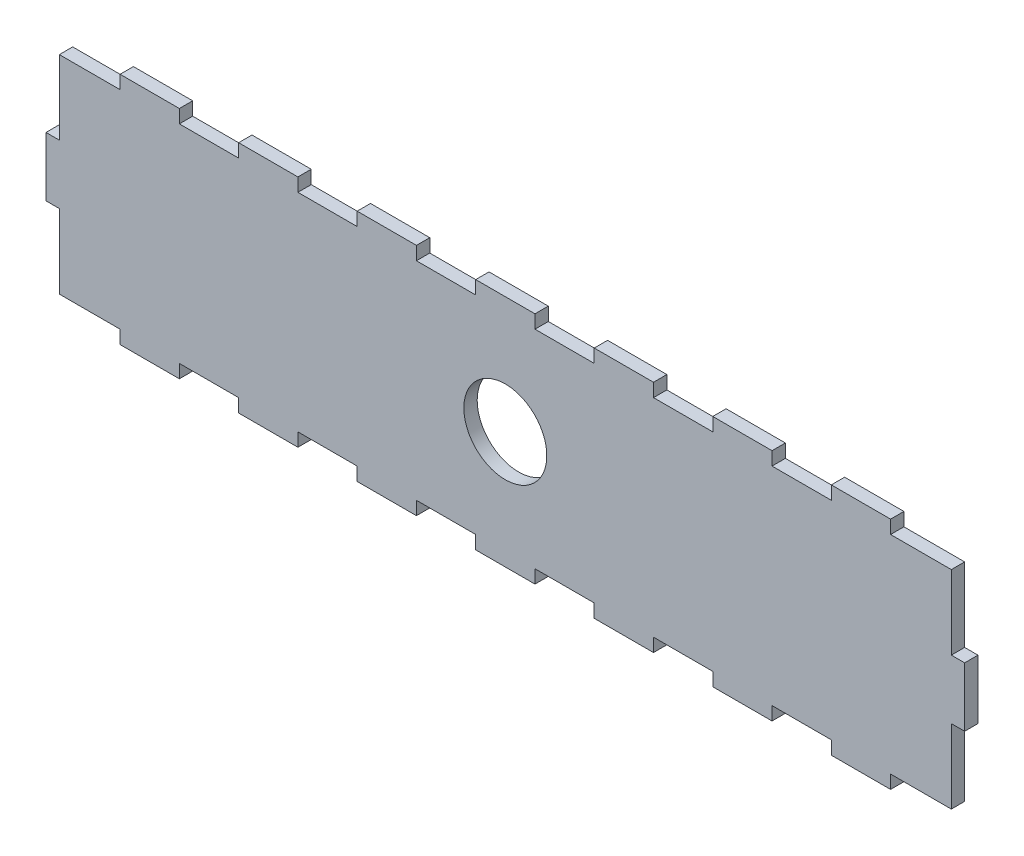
ISO-10303-21;
HEADER;
FILE_DESCRIPTION(('STEP AP214'),'2;1');
FILE_NAME('part.step','',(''),(''),'','','');
FILE_SCHEMA(('AUTOMOTIVE_DESIGN { 1 0 10303 214 1 1 1 1 }'));
ENDSEC;
DATA;
#1=APPLICATION_CONTEXT('core data for automotive mechanical design processes');
#2=APPLICATION_PROTOCOL_DEFINITION('international standard','automotive_design',2000,#1);
#3=PRODUCT_CONTEXT('',#1,'mechanical');
#4=PRODUCT('Part','Part','',(#3));
#5=PRODUCT_RELATED_PRODUCT_CATEGORY('part','',(#4));
#6=PRODUCT_DEFINITION_FORMATION('','',#4);
#7=PRODUCT_DEFINITION_CONTEXT('part definition',#1,'design');
#8=PRODUCT_DEFINITION('design','',#6,#7);
#9=PRODUCT_DEFINITION_SHAPE('','',#8);
#10=(LENGTH_UNIT() NAMED_UNIT(*) SI_UNIT(.MILLI.,.METRE.));
#11=(NAMED_UNIT(*) PLANE_ANGLE_UNIT() SI_UNIT($,.RADIAN.));
#12=(NAMED_UNIT(*) SI_UNIT($,.STERADIAN.) SOLID_ANGLE_UNIT());
#13=UNCERTAINTY_MEASURE_WITH_UNIT(LENGTH_MEASURE(1.E-05),#10,'distance_accuracy_value','');
#14=(GEOMETRIC_REPRESENTATION_CONTEXT(3) GLOBAL_UNCERTAINTY_ASSIGNED_CONTEXT((#13)) GLOBAL_UNIT_ASSIGNED_CONTEXT((#10,
#11,#12)) REPRESENTATION_CONTEXT('',''));
#15=CARTESIAN_POINT('',(0.,0.,0.));
#16=DIRECTION('',(0.,0.,1.));
#17=DIRECTION('',(1.,0.,0.));
#18=AXIS2_PLACEMENT_3D('',#15,#16,#17);
#19=CARTESIAN_POINT('',(155.,-35.,4.5));
#20=DIRECTION('',(0.,1.,0.));
#21=DIRECTION('',(-1.,0.,0.));
#22=AXIS2_PLACEMENT_3D('',#19,#20,#21);
#23=PLANE('',#22);
#24=DIRECTION('',(1.,0.,0.));
#25=VECTOR('',#24,1.);
#26=CARTESIAN_POINT('',(155.,-35.,0.));
#27=LINE('',#26,#25);
#28=CARTESIAN_POINT('',(90.,-35.,0.));
#29=VERTEX_POINT('',#28);
#30=CARTESIAN_POINT('',(110.,-35.,0.));
#31=VERTEX_POINT('',#30);
#32=EDGE_CURVE('E1005',#29,#31,#27,.T.);
#33=ORIENTED_EDGE('',*,*,#32,.T.);
#34=DIRECTION('',(0.,0.,1.));
#35=VECTOR('',#34,1.);
#36=CARTESIAN_POINT('',(110.,-35.,0.));
#37=LINE('',#36,#35);
#38=CARTESIAN_POINT('',(110.,-35.,4.5));
#39=VERTEX_POINT('',#38);
#40=EDGE_CURVE('E533',#31,#39,#37,.T.);
#41=ORIENTED_EDGE('',*,*,#40,.T.);
#42=DIRECTION('',(1.,0.,0.));
#43=VECTOR('',#42,1.);
#44=CARTESIAN_POINT('',(155.,-35.,4.5));
#45=LINE('',#44,#43);
#46=CARTESIAN_POINT('',(90.,-35.,4.5));
#47=VERTEX_POINT('',#46);
#48=EDGE_CURVE('E984',#47,#39,#45,.T.);
#49=ORIENTED_EDGE('',*,*,#48,.F.);
#50=DIRECTION('',(0.,0.,1.));
#51=VECTOR('',#50,1.);
#52=CARTESIAN_POINT('',(90.,-35.,0.));
#53=LINE('',#52,#51);
#54=EDGE_CURVE('E563',#29,#47,#53,.T.);
#55=ORIENTED_EDGE('',*,*,#54,.F.);
#56=EDGE_LOOP('',(#33,#41,#49,#55));
#57=FACE_BOUND('',#56,.T.);
#58=ADVANCED_FACE('F17',(#57),#23,.F.);
#59=CARTESIAN_POINT('',(50.0000000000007,-35.,0.));
#60=VERTEX_POINT('',#59);
#61=CARTESIAN_POINT('',(70.,-35.,0.));
#62=VERTEX_POINT('',#61);
#63=EDGE_CURVE('E1004',#60,#62,#27,.T.);
#64=ORIENTED_EDGE('',*,*,#63,.T.);
#65=DIRECTION('',(0.,0.,1.));
#66=VECTOR('',#65,1.);
#67=CARTESIAN_POINT('',(70.,-35.,0.));
#68=LINE('',#67,#66);
#69=CARTESIAN_POINT('',(70.,-35.,4.5));
#70=VERTEX_POINT('',#69);
#71=EDGE_CURVE('E560',#62,#70,#68,.T.);
#72=ORIENTED_EDGE('',*,*,#71,.T.);
#73=CARTESIAN_POINT('',(50.0000000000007,-35.,4.5));
#74=VERTEX_POINT('',#73);
#75=EDGE_CURVE('E981',#74,#70,#45,.T.);
#76=ORIENTED_EDGE('',*,*,#75,.F.);
#77=DIRECTION('',(0.,0.,1.));
#78=VECTOR('',#77,1.);
#79=CARTESIAN_POINT('',(50.0000000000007,-35.,0.));
#80=LINE('',#79,#78);
#81=EDGE_CURVE('E590',#60,#74,#80,.T.);
#82=ORIENTED_EDGE('',*,*,#81,.F.);
#83=EDGE_LOOP('',(#64,#72,#76,#82));
#84=FACE_BOUND('',#83,.T.);
#85=ADVANCED_FACE('F1182',(#84),#23,.F.);
#86=CARTESIAN_POINT('',(10.0000000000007,-35.,0.));
#87=VERTEX_POINT('',#86);
#88=CARTESIAN_POINT('',(30.0000000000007,-35.,0.));
#89=VERTEX_POINT('',#88);
#90=EDGE_CURVE('E1002',#87,#89,#27,.T.);
#91=ORIENTED_EDGE('',*,*,#90,.T.);
#92=DIRECTION('',(0.,0.,1.));
#93=VECTOR('',#92,1.);
#94=CARTESIAN_POINT('',(30.0000000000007,-35.,0.));
#95=LINE('',#94,#93);
#96=CARTESIAN_POINT('',(30.0000000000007,-35.,4.5));
#97=VERTEX_POINT('',#96);
#98=EDGE_CURVE('E587',#89,#97,#95,.T.);
#99=ORIENTED_EDGE('',*,*,#98,.T.);
#100=CARTESIAN_POINT('',(10.0000000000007,-35.,4.5));
#101=VERTEX_POINT('',#100);
#102=EDGE_CURVE('E977',#101,#97,#45,.T.);
#103=ORIENTED_EDGE('',*,*,#102,.F.);
#104=DIRECTION('',(0.,0.,1.));
#105=VECTOR('',#104,1.);
#106=CARTESIAN_POINT('',(10.0000000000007,-35.,0.));
#107=LINE('',#106,#105);
#108=EDGE_CURVE('E617',#87,#101,#107,.T.);
#109=ORIENTED_EDGE('',*,*,#108,.F.);
#110=EDGE_LOOP('',(#91,#99,#103,#109));
#111=FACE_BOUND('',#110,.T.);
#112=ADVANCED_FACE('F1187',(#111),#23,.F.);
#113=CARTESIAN_POINT('',(-29.9999999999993,-35.,0.));
#114=VERTEX_POINT('',#113);
#115=CARTESIAN_POINT('',(-9.99999999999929,-35.,0.));
#116=VERTEX_POINT('',#115);
#117=EDGE_CURVE('E1000',#114,#116,#27,.T.);
#118=ORIENTED_EDGE('',*,*,#117,.T.);
#119=DIRECTION('',(0.,0.,1.));
#120=VECTOR('',#119,1.);
#121=CARTESIAN_POINT('',(-9.99999999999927,-35.,0.));
#122=LINE('',#121,#120);
#123=CARTESIAN_POINT('',(-9.99999999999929,-35.,4.5));
#124=VERTEX_POINT('',#123);
#125=EDGE_CURVE('E614',#116,#124,#122,.T.);
#126=ORIENTED_EDGE('',*,*,#125,.T.);
#127=CARTESIAN_POINT('',(-29.9999999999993,-35.,4.5));
#128=VERTEX_POINT('',#127);
#129=EDGE_CURVE('E973',#128,#124,#45,.T.);
#130=ORIENTED_EDGE('',*,*,#129,.F.);
#131=DIRECTION('',(0.,0.,1.));
#132=VECTOR('',#131,1.);
#133=CARTESIAN_POINT('',(-29.9999999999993,-35.,0.));
#134=LINE('',#133,#132);
#135=EDGE_CURVE('E644',#114,#128,#134,.T.);
#136=ORIENTED_EDGE('',*,*,#135,.F.);
#137=EDGE_LOOP('',(#118,#126,#130,#136));
#138=FACE_BOUND('',#137,.T.);
#139=ADVANCED_FACE('F1215',(#138),#23,.F.);
#140=CARTESIAN_POINT('',(-70.,-35.,0.));
#141=VERTEX_POINT('',#140);
#142=CARTESIAN_POINT('',(-49.9999999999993,-35.,0.));
#143=VERTEX_POINT('',#142);
#144=EDGE_CURVE('E920',#141,#143,#27,.T.);
#145=ORIENTED_EDGE('',*,*,#144,.T.);
#146=DIRECTION('',(0.,0.,1.));
#147=VECTOR('',#146,1.);
#148=CARTESIAN_POINT('',(-49.9999999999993,-35.,0.));
#149=LINE('',#148,#147);
#150=CARTESIAN_POINT('',(-49.9999999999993,-35.,4.5));
#151=VERTEX_POINT('',#150);
#152=EDGE_CURVE('E641',#143,#151,#149,.T.);
#153=ORIENTED_EDGE('',*,*,#152,.T.);
#154=CARTESIAN_POINT('',(-70.,-35.,4.5));
#155=VERTEX_POINT('',#154);
#156=EDGE_CURVE('E955',#155,#151,#45,.T.);
#157=ORIENTED_EDGE('',*,*,#156,.F.);
#158=DIRECTION('',(0.,0.,1.));
#159=VECTOR('',#158,1.);
#160=CARTESIAN_POINT('',(-70.,-35.,0.));
#161=LINE('',#160,#159);
#162=EDGE_CURVE('E671',#141,#155,#161,.T.);
#163=ORIENTED_EDGE('',*,*,#162,.F.);
#164=EDGE_LOOP('',(#145,#153,#157,#163));
#165=FACE_BOUND('',#164,.T.);
#166=ADVANCED_FACE('F1140',(#165),#23,.F.);
#167=CARTESIAN_POINT('',(-110.,-35.,0.));
#168=VERTEX_POINT('',#167);
#169=CARTESIAN_POINT('',(-90.,-35.,0.));
#170=VERTEX_POINT('',#169);
#171=EDGE_CURVE('E992',#168,#170,#27,.T.);
#172=ORIENTED_EDGE('',*,*,#171,.T.);
#173=DIRECTION('',(0.,0.,1.));
#174=VECTOR('',#173,1.);
#175=CARTESIAN_POINT('',(-90.,-35.,0.));
#176=LINE('',#175,#174);
#177=CARTESIAN_POINT('',(-90.,-35.,4.5));
#178=VERTEX_POINT('',#177);
#179=EDGE_CURVE('E668',#170,#178,#176,.T.);
#180=ORIENTED_EDGE('',*,*,#179,.T.);
#181=CARTESIAN_POINT('',(-110.,-35.,4.5));
#182=VERTEX_POINT('',#181);
#183=EDGE_CURVE('E948',#182,#178,#45,.T.);
#184=ORIENTED_EDGE('',*,*,#183,.F.);
#185=DIRECTION('',(0.,0.,1.));
#186=VECTOR('',#185,1.);
#187=CARTESIAN_POINT('',(-110.,-35.,0.));
#188=LINE('',#187,#186);
#189=EDGE_CURVE('E864',#168,#182,#188,.T.);
#190=ORIENTED_EDGE('',*,*,#189,.F.);
#191=EDGE_LOOP('',(#172,#180,#184,#190));
#192=FACE_BOUND('',#191,.T.);
#193=ADVANCED_FACE('F1123',(#192),#23,.F.);
#194=CARTESIAN_POINT('',(155.,35.,4.5));
#195=DIRECTION('',(0.,-1.,0.));
#196=DIRECTION('',(1.,0.,0.));
#197=AXIS2_PLACEMENT_3D('',#194,#195,#196);
#198=PLANE('',#197);
#199=DIRECTION('',(-1.,0.,0.));
#200=VECTOR('',#199,1.);
#201=CARTESIAN_POINT('',(155.,35.,4.5));
#202=LINE('',#201,#200);
#203=CARTESIAN_POINT('',(110.,35.,4.5));
#204=VERTEX_POINT('',#203);
#205=CARTESIAN_POINT('',(90.,35.,4.5));
#206=VERTEX_POINT('',#205);
#207=EDGE_CURVE('E917',#204,#206,#202,.T.);
#208=ORIENTED_EDGE('',*,*,#207,.F.);
#209=DIRECTION('',(0.,0.,1.));
#210=VECTOR('',#209,1.);
#211=CARTESIAN_POINT('',(110.,35.,0.));
#212=LINE('',#211,#210);
#213=CARTESIAN_POINT('',(110.,35.,0.));
#214=VERTEX_POINT('',#213);
#215=EDGE_CURVE('E687',#214,#204,#212,.T.);
#216=ORIENTED_EDGE('',*,*,#215,.F.);
#217=DIRECTION('',(-1.,0.,0.));
#218=VECTOR('',#217,1.);
#219=CARTESIAN_POINT('',(155.,35.,0.));
#220=LINE('',#219,#218);
#221=CARTESIAN_POINT('',(90.,35.,0.));
#222=VERTEX_POINT('',#221);
#223=EDGE_CURVE('E913',#214,#222,#220,.T.);
#224=ORIENTED_EDGE('',*,*,#223,.T.);
#225=DIRECTION('',(0.,0.,1.));
#226=VECTOR('',#225,1.);
#227=CARTESIAN_POINT('',(90.,35.,0.));
#228=LINE('',#227,#226);
#229=EDGE_CURVE('E728',#222,#206,#228,.T.);
#230=ORIENTED_EDGE('',*,*,#229,.T.);
#231=EDGE_LOOP('',(#208,#216,#224,#230));
#232=FACE_BOUND('',#231,.T.);
#233=ADVANCED_FACE('F1207',(#232),#198,.F.);
#234=CARTESIAN_POINT('',(70.,35.,4.5));
#235=VERTEX_POINT('',#234);
#236=CARTESIAN_POINT('',(50.,35.,4.5));
#237=VERTEX_POINT('',#236);
#238=EDGE_CURVE('E916',#235,#237,#202,.T.);
#239=ORIENTED_EDGE('',*,*,#238,.F.);
#240=DIRECTION('',(0.,0.,1.));
#241=VECTOR('',#240,1.);
#242=CARTESIAN_POINT('',(70.,35.,0.));
#243=LINE('',#242,#241);
#244=CARTESIAN_POINT('',(70.,35.,0.));
#245=VERTEX_POINT('',#244);
#246=EDGE_CURVE('E715',#245,#235,#243,.T.);
#247=ORIENTED_EDGE('',*,*,#246,.F.);
#248=CARTESIAN_POINT('',(50.,35.,0.));
#249=VERTEX_POINT('',#248);
#250=EDGE_CURVE('E910',#245,#249,#220,.T.);
#251=ORIENTED_EDGE('',*,*,#250,.T.);
#252=DIRECTION('',(0.,0.,1.));
#253=VECTOR('',#252,1.);
#254=CARTESIAN_POINT('',(50.,35.,0.));
#255=LINE('',#254,#253);
#256=EDGE_CURVE('E756',#249,#237,#255,.T.);
#257=ORIENTED_EDGE('',*,*,#256,.T.);
#258=EDGE_LOOP('',(#239,#247,#251,#257));
#259=FACE_BOUND('',#258,.T.);
#260=ADVANCED_FACE('F1213',(#259),#198,.F.);
#261=CARTESIAN_POINT('',(30.,35.,4.5));
#262=VERTEX_POINT('',#261);
#263=CARTESIAN_POINT('',(10.,35.,4.5));
#264=VERTEX_POINT('',#263);
#265=EDGE_CURVE('E939',#262,#264,#202,.T.);
#266=ORIENTED_EDGE('',*,*,#265,.F.);
#267=DIRECTION('',(0.,0.,1.));
#268=VECTOR('',#267,1.);
#269=CARTESIAN_POINT('',(30.,35.,0.));
#270=LINE('',#269,#268);
#271=CARTESIAN_POINT('',(30.,35.,0.));
#272=VERTEX_POINT('',#271);
#273=EDGE_CURVE('E743',#272,#262,#270,.T.);
#274=ORIENTED_EDGE('',*,*,#273,.F.);
#275=CARTESIAN_POINT('',(10.,35.,0.));
#276=VERTEX_POINT('',#275);
#277=EDGE_CURVE('E907',#272,#276,#220,.T.);
#278=ORIENTED_EDGE('',*,*,#277,.T.);
#279=DIRECTION('',(0.,0.,1.));
#280=VECTOR('',#279,1.);
#281=CARTESIAN_POINT('',(10.,35.,0.));
#282=LINE('',#281,#280);
#283=EDGE_CURVE('E784',#276,#264,#282,.T.);
#284=ORIENTED_EDGE('',*,*,#283,.T.);
#285=EDGE_LOOP('',(#266,#274,#278,#284));
#286=FACE_BOUND('',#285,.T.);
#287=ADVANCED_FACE('F1753',(#286),#198,.F.);
#288=CARTESIAN_POINT('',(-10.,35.,4.5));
#289=VERTEX_POINT('',#288);
#290=CARTESIAN_POINT('',(-30.,35.,4.5));
#291=VERTEX_POINT('',#290);
#292=EDGE_CURVE('E937',#289,#291,#202,.T.);
#293=ORIENTED_EDGE('',*,*,#292,.F.);
#294=DIRECTION('',(0.,0.,1.));
#295=VECTOR('',#294,1.);
#296=CARTESIAN_POINT('',(-10.,35.,0.));
#297=LINE('',#296,#295);
#298=CARTESIAN_POINT('',(-10.,35.,0.));
#299=VERTEX_POINT('',#298);
#300=EDGE_CURVE('E771',#299,#289,#297,.T.);
#301=ORIENTED_EDGE('',*,*,#300,.F.);
#302=CARTESIAN_POINT('',(-30.,35.,0.));
#303=VERTEX_POINT('',#302);
#304=EDGE_CURVE('E903',#299,#303,#220,.T.);
#305=ORIENTED_EDGE('',*,*,#304,.T.);
#306=DIRECTION('',(0.,0.,1.));
#307=VECTOR('',#306,1.);
#308=CARTESIAN_POINT('',(-30.,35.,0.));
#309=LINE('',#308,#307);
#310=EDGE_CURVE('E812',#303,#291,#309,.T.);
#311=ORIENTED_EDGE('',*,*,#310,.T.);
#312=EDGE_LOOP('',(#293,#301,#305,#311));
#313=FACE_BOUND('',#312,.T.);
#314=ADVANCED_FACE('F1744',(#313),#198,.F.);
#315=CARTESIAN_POINT('',(-50.,35.,4.5));
#316=VERTEX_POINT('',#315);
#317=CARTESIAN_POINT('',(-70.,35.,4.5));
#318=VERTEX_POINT('',#317);
#319=EDGE_CURVE('E935',#316,#318,#202,.T.);
#320=ORIENTED_EDGE('',*,*,#319,.F.);
#321=DIRECTION('',(0.,0.,1.));
#322=VECTOR('',#321,1.);
#323=CARTESIAN_POINT('',(-50.,35.,0.));
#324=LINE('',#323,#322);
#325=CARTESIAN_POINT('',(-50.,35.,0.));
#326=VERTEX_POINT('',#325);
#327=EDGE_CURVE('E799',#326,#316,#324,.T.);
#328=ORIENTED_EDGE('',*,*,#327,.F.);
#329=CARTESIAN_POINT('',(-70.,35.,0.));
#330=VERTEX_POINT('',#329);
#331=EDGE_CURVE('E884',#326,#330,#220,.T.);
#332=ORIENTED_EDGE('',*,*,#331,.T.);
#333=DIRECTION('',(0.,0.,1.));
#334=VECTOR('',#333,1.);
#335=CARTESIAN_POINT('',(-70.,35.,0.));
#336=LINE('',#335,#334);
#337=EDGE_CURVE('E840',#330,#318,#336,.T.);
#338=ORIENTED_EDGE('',*,*,#337,.T.);
#339=EDGE_LOOP('',(#320,#328,#332,#338));
#340=FACE_BOUND('',#339,.T.);
#341=ADVANCED_FACE('F1204',(#340),#198,.F.);
#342=CARTESIAN_POINT('',(-90.,35.,4.5));
#343=VERTEX_POINT('',#342);
#344=CARTESIAN_POINT('',(-110.,35.,4.5));
#345=VERTEX_POINT('',#344);
#346=EDGE_CURVE('E886',#343,#345,#202,.T.);
#347=ORIENTED_EDGE('',*,*,#346,.F.);
#348=DIRECTION('',(0.,0.,1.));
#349=VECTOR('',#348,1.);
#350=CARTESIAN_POINT('',(-90.,35.,0.));
#351=LINE('',#350,#349);
#352=CARTESIAN_POINT('',(-90.,35.,0.));
#353=VERTEX_POINT('',#352);
#354=EDGE_CURVE('E827',#353,#343,#351,.T.);
#355=ORIENTED_EDGE('',*,*,#354,.F.);
#356=CARTESIAN_POINT('',(-110.,35.,0.));
#357=VERTEX_POINT('',#356);
#358=EDGE_CURVE('E881',#353,#357,#220,.T.);
#359=ORIENTED_EDGE('',*,*,#358,.T.);
#360=DIRECTION('',(0.,0.,1.));
#361=VECTOR('',#360,1.);
#362=CARTESIAN_POINT('',(-110.,35.,0.));
#363=LINE('',#362,#361);
#364=EDGE_CURVE('E1031',#357,#345,#363,.T.);
#365=ORIENTED_EDGE('',*,*,#364,.T.);
#366=EDGE_LOOP('',(#347,#355,#359,#365));
#367=FACE_BOUND('',#366,.T.);
#368=ADVANCED_FACE('F1197',(#367),#198,.F.);
#369=CARTESIAN_POINT('',(130.,-35.,0.));
#370=VERTEX_POINT('',#369);
#371=CARTESIAN_POINT('',(150.5,-35.,0.));
#372=VERTEX_POINT('',#371);
#373=EDGE_CURVE('E988',#370,#372,#27,.T.);
#374=ORIENTED_EDGE('',*,*,#373,.T.);
#375=DIRECTION('',(0.,0.,1.));
#376=VECTOR('',#375,1.);
#377=CARTESIAN_POINT('',(150.5,-35.,4.5));
#378=LINE('',#377,#376);
#379=CARTESIAN_POINT('',(150.5,-35.,4.5));
#380=VERTEX_POINT('',#379);
#381=EDGE_CURVE('E465',#372,#380,#378,.T.);
#382=ORIENTED_EDGE('',*,*,#381,.T.);
#383=CARTESIAN_POINT('',(130.,-35.,4.5));
#384=VERTEX_POINT('',#383);
#385=EDGE_CURVE('E460',#384,#380,#45,.T.);
#386=ORIENTED_EDGE('',*,*,#385,.F.);
#387=DIRECTION('',(0.,0.,1.));
#388=VECTOR('',#387,1.);
#389=CARTESIAN_POINT('',(130.,-35.,0.));
#390=LINE('',#389,#388);
#391=EDGE_CURVE('E536',#370,#384,#390,.T.);
#392=ORIENTED_EDGE('',*,*,#391,.F.);
#393=EDGE_LOOP('',(#374,#382,#386,#392));
#394=FACE_BOUND('',#393,.T.);
#395=ADVANCED_FACE('F1162',(#394),#23,.F.);
#396=CARTESIAN_POINT('',(-130.,35.,0.));
#397=VERTEX_POINT('',#396);
#398=CARTESIAN_POINT('',(-150.5,35.,0.));
#399=VERTEX_POINT('',#398);
#400=EDGE_CURVE('E885',#397,#399,#220,.T.);
#401=ORIENTED_EDGE('',*,*,#400,.T.);
#402=DIRECTION('',(0.,0.,1.));
#403=VECTOR('',#402,1.);
#404=CARTESIAN_POINT('',(-150.5,35.,4.5));
#405=LINE('',#404,#403);
#406=CARTESIAN_POINT('',(-150.5,35.,4.5));
#407=VERTEX_POINT('',#406);
#408=EDGE_CURVE('E512',#399,#407,#405,.T.);
#409=ORIENTED_EDGE('',*,*,#408,.T.);
#410=CARTESIAN_POINT('',(-130.,35.,4.5));
#411=VERTEX_POINT('',#410);
#412=EDGE_CURVE('E930',#411,#407,#202,.T.);
#413=ORIENTED_EDGE('',*,*,#412,.F.);
#414=DIRECTION('',(0.,0.,1.));
#415=VECTOR('',#414,1.);
#416=CARTESIAN_POINT('',(-130.,35.,0.));
#417=LINE('',#416,#415);
#418=EDGE_CURVE('E1028',#397,#411,#417,.T.);
#419=ORIENTED_EDGE('',*,*,#418,.F.);
#420=EDGE_LOOP('',(#401,#409,#413,#419));
#421=FACE_BOUND('',#420,.T.);
#422=ADVANCED_FACE('F1071',(#421),#198,.F.);
#423=CARTESIAN_POINT('',(-155.,-35.,4.5));
#424=DIRECTION('',(1.,0.,0.));
#425=DIRECTION('',(0.,0.,-1.));
#426=AXIS2_PLACEMENT_3D('',#423,#424,#425);
#427=PLANE('',#426);
#428=DIRECTION('',(0.,-1.,0.));
#429=VECTOR('',#428,1.);
#430=CARTESIAN_POINT('',(-155.,-35.,0.));
#431=LINE('',#430,#429);
#432=CARTESIAN_POINT('',(-155.,10.,0.));
#433=VERTEX_POINT('',#432);
#434=CARTESIAN_POINT('',(-155.,-10.,0.));
#435=VERTEX_POINT('',#434);
#436=EDGE_CURVE('E927',#433,#435,#431,.T.);
#437=ORIENTED_EDGE('',*,*,#436,.T.);
#438=DIRECTION('',(0.,0.,1.));
#439=VECTOR('',#438,1.);
#440=CARTESIAN_POINT('',(-155.,-10.,4.5));
#441=LINE('',#440,#439);
#442=CARTESIAN_POINT('',(-155.,-10.,4.5));
#443=VERTEX_POINT('',#442);
#444=EDGE_CURVE('E496',#435,#443,#441,.T.);
#445=ORIENTED_EDGE('',*,*,#444,.T.);
#446=DIRECTION('',(0.,-1.,0.));
#447=VECTOR('',#446,1.);
#448=CARTESIAN_POINT('',(-155.,-35.,4.5));
#449=LINE('',#448,#447);
#450=CARTESIAN_POINT('',(-155.,10.,4.5));
#451=VERTEX_POINT('',#450);
#452=EDGE_CURVE('E963',#451,#443,#449,.T.);
#453=ORIENTED_EDGE('',*,*,#452,.F.);
#454=DIRECTION('',(0.,0.,-1.));
#455=VECTOR('',#454,1.);
#456=CARTESIAN_POINT('',(-155.,10.,4.5));
#457=LINE('',#456,#455);
#458=EDGE_CURVE('E509',#451,#433,#457,.T.);
#459=ORIENTED_EDGE('',*,*,#458,.T.);
#460=EDGE_LOOP('',(#437,#445,#453,#459));
#461=FACE_BOUND('',#460,.T.);
#462=ADVANCED_FACE('F19',(#461),#427,.F.);
#463=CARTESIAN_POINT('',(-150.5,-35.,4.5));
#464=VERTEX_POINT('',#463);
#465=CARTESIAN_POINT('',(-130.,-35.,4.5));
#466=VERTEX_POINT('',#465);
#467=EDGE_CURVE('E946',#464,#466,#45,.T.);
#468=ORIENTED_EDGE('',*,*,#467,.F.);
#469=DIRECTION('',(0.,0.,-1.));
#470=VECTOR('',#469,1.);
#471=CARTESIAN_POINT('',(-150.5,-35.,4.5));
#472=LINE('',#471,#470);
#473=CARTESIAN_POINT('',(-150.5,-35.,0.));
#474=VERTEX_POINT('',#473);
#475=EDGE_CURVE('E493',#464,#474,#472,.T.);
#476=ORIENTED_EDGE('',*,*,#475,.T.);
#477=CARTESIAN_POINT('',(-130.,-35.,0.));
#478=VERTEX_POINT('',#477);
#479=EDGE_CURVE('E991',#474,#478,#27,.T.);
#480=ORIENTED_EDGE('',*,*,#479,.T.);
#481=DIRECTION('',(0.,0.,1.));
#482=VECTOR('',#481,1.);
#483=CARTESIAN_POINT('',(-130.,-35.,0.));
#484=LINE('',#483,#482);
#485=EDGE_CURVE('E859',#478,#466,#484,.T.);
#486=ORIENTED_EDGE('',*,*,#485,.T.);
#487=EDGE_LOOP('',(#468,#476,#480,#486));
#488=FACE_BOUND('',#487,.T.);
#489=ADVANCED_FACE('F1107',(#488),#23,.F.);
#490=CARTESIAN_POINT('',(155.,-35.,4.5));
#491=DIRECTION('',(-1.,0.,0.));
#492=DIRECTION('',(0.,0.,1.));
#493=AXIS2_PLACEMENT_3D('',#490,#491,#492);
#494=PLANE('',#493);
#495=DIRECTION('',(0.,1.,0.));
#496=VECTOR('',#495,1.);
#497=CARTESIAN_POINT('',(155.,-35.,4.5));
#498=LINE('',#497,#496);
#499=CARTESIAN_POINT('',(155.,-10.,4.5));
#500=VERTEX_POINT('',#499);
#501=CARTESIAN_POINT('',(155.,10.,4.5));
#502=VERTEX_POINT('',#501);
#503=EDGE_CURVE('E925',#500,#502,#498,.T.);
#504=ORIENTED_EDGE('',*,*,#503,.F.);
#505=DIRECTION('',(0.,0.,-1.));
#506=VECTOR('',#505,1.);
#507=CARTESIAN_POINT('',(155.,-10.,4.5));
#508=LINE('',#507,#506);
#509=CARTESIAN_POINT('',(155.,-10.,0.));
#510=VERTEX_POINT('',#509);
#511=EDGE_CURVE('E447',#500,#510,#508,.T.);
#512=ORIENTED_EDGE('',*,*,#511,.T.);
#513=DIRECTION('',(0.,1.,0.));
#514=VECTOR('',#513,1.);
#515=CARTESIAN_POINT('',(155.,-35.,0.));
#516=LINE('',#515,#514);
#517=CARTESIAN_POINT('',(155.,10.,0.));
#518=VERTEX_POINT('',#517);
#519=EDGE_CURVE('E40',#510,#518,#516,.T.);
#520=ORIENTED_EDGE('',*,*,#519,.T.);
#521=DIRECTION('',(0.,0.,1.));
#522=VECTOR('',#521,1.);
#523=CARTESIAN_POINT('',(155.,10.,4.5));
#524=LINE('',#523,#522);
#525=EDGE_CURVE('E478',#518,#502,#524,.T.);
#526=ORIENTED_EDGE('',*,*,#525,.T.);
#527=EDGE_LOOP('',(#504,#512,#520,#526));
#528=FACE_BOUND('',#527,.T.);
#529=ADVANCED_FACE('F1163',(#528),#494,.F.);
#530=CARTESIAN_POINT('',(150.5,35.,4.5));
#531=VERTEX_POINT('',#530);
#532=CARTESIAN_POINT('',(130.,35.,4.5));
#533=VERTEX_POINT('',#532);
#534=EDGE_CURVE('E919',#531,#533,#202,.T.);
#535=ORIENTED_EDGE('',*,*,#534,.F.);
#536=DIRECTION('',(0.,0.,-1.));
#537=VECTOR('',#536,1.);
#538=CARTESIAN_POINT('',(150.5,35.,4.5));
#539=LINE('',#538,#537);
#540=CARTESIAN_POINT('',(150.5,35.,0.));
#541=VERTEX_POINT('',#540);
#542=EDGE_CURVE('E480',#531,#541,#539,.T.);
#543=ORIENTED_EDGE('',*,*,#542,.T.);
#544=CARTESIAN_POINT('',(130.,35.,0.));
#545=VERTEX_POINT('',#544);
#546=EDGE_CURVE('E915',#541,#545,#220,.T.);
#547=ORIENTED_EDGE('',*,*,#546,.T.);
#548=DIRECTION('',(0.,0.,1.));
#549=VECTOR('',#548,1.);
#550=CARTESIAN_POINT('',(130.,35.,0.));
#551=LINE('',#550,#549);
#552=EDGE_CURVE('E700',#545,#533,#551,.T.);
#553=ORIENTED_EDGE('',*,*,#552,.T.);
#554=EDGE_LOOP('',(#535,#543,#547,#553));
#555=FACE_BOUND('',#554,.T.);
#556=ADVANCED_FACE('F1087',(#555),#198,.F.);
#557=CARTESIAN_POINT('',(0.,0.,4.5));
#558=DIRECTION('',(0.,0.,1.));
#559=DIRECTION('',(1.,0.,0.));
#560=AXIS2_PLACEMENT_3D('',#557,#558,#559);
#561=PLANE('',#560);
#562=DIRECTION('',(0.,-1.,0.));
#563=VECTOR('',#562,1.);
#564=CARTESIAN_POINT('',(150.5,-10.,4.5));
#565=LINE('',#564,#563);
#566=CARTESIAN_POINT('',(150.5,-10.,4.5));
#567=VERTEX_POINT('',#566);
#568=EDGE_CURVE('E451',#567,#380,#565,.T.);
#569=ORIENTED_EDGE('',*,*,#568,.F.);
#570=DIRECTION('',(-1.,0.,0.));
#571=VECTOR('',#570,1.);
#572=CARTESIAN_POINT('',(150.5,-10.,4.5));
#573=LINE('',#572,#571);
#574=EDGE_CURVE('E444',#500,#567,#573,.T.);
#575=ORIENTED_EDGE('',*,*,#574,.F.);
#576=ORIENTED_EDGE('',*,*,#503,.T.);
#577=DIRECTION('',(1.,0.,0.));
#578=VECTOR('',#577,1.);
#579=CARTESIAN_POINT('',(150.5,10.,4.5));
#580=LINE('',#579,#578);
#581=CARTESIAN_POINT('',(150.5,10.,4.5));
#582=VERTEX_POINT('',#581);
#583=EDGE_CURVE('E472',#582,#502,#580,.T.);
#584=ORIENTED_EDGE('',*,*,#583,.F.);
#585=DIRECTION('',(0.,-1.,0.));
#586=VECTOR('',#585,1.);
#587=CARTESIAN_POINT('',(150.5,42.7956220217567,4.5));
#588=LINE('',#587,#586);
#589=EDGE_CURVE('E467',#531,#582,#588,.T.);
#590=ORIENTED_EDGE('',*,*,#589,.F.);
#591=ORIENTED_EDGE('',*,*,#534,.T.);
#592=DIRECTION('',(0.,1.,0.));
#593=VECTOR('',#592,1.);
#594=CARTESIAN_POINT('',(130.,35.,4.5));
#595=LINE('',#594,#593);
#596=CARTESIAN_POINT('',(130.,39.5,4.5));
#597=VERTEX_POINT('',#596);
#598=EDGE_CURVE('E690',#533,#597,#595,.T.);
#599=ORIENTED_EDGE('',*,*,#598,.T.);
#600=DIRECTION('',(-1.,0.,0.));
#601=VECTOR('',#600,1.);
#602=CARTESIAN_POINT('',(110.,39.5,4.5));
#603=LINE('',#602,#601);
#604=CARTESIAN_POINT('',(110.,39.5,4.5));
#605=VERTEX_POINT('',#604);
#606=EDGE_CURVE('E681',#597,#605,#603,.T.);
#607=ORIENTED_EDGE('',*,*,#606,.T.);
#608=DIRECTION('',(0.,-1.,0.));
#609=VECTOR('',#608,1.);
#610=CARTESIAN_POINT('',(110.,35.,4.5));
#611=LINE('',#610,#609);
#612=EDGE_CURVE('E670',#605,#204,#611,.T.);
#613=ORIENTED_EDGE('',*,*,#612,.T.);
#614=ORIENTED_EDGE('',*,*,#207,.T.);
#615=DIRECTION('',(0.,1.,0.));
#616=VECTOR('',#615,1.);
#617=CARTESIAN_POINT('',(90.,35.,4.5));
#618=LINE('',#617,#616);
#619=CARTESIAN_POINT('',(90.,39.5,4.5));
#620=VERTEX_POINT('',#619);
#621=EDGE_CURVE('E718',#206,#620,#618,.T.);
#622=ORIENTED_EDGE('',*,*,#621,.T.);
#623=DIRECTION('',(-1.,0.,0.));
#624=VECTOR('',#623,1.);
#625=CARTESIAN_POINT('',(70.,39.5,4.5));
#626=LINE('',#625,#624);
#627=CARTESIAN_POINT('',(70.,39.5,4.5));
#628=VERTEX_POINT('',#627);
#629=EDGE_CURVE('E709',#620,#628,#626,.T.);
#630=ORIENTED_EDGE('',*,*,#629,.T.);
#631=DIRECTION('',(0.,-1.,0.));
#632=VECTOR('',#631,1.);
#633=CARTESIAN_POINT('',(70.,35.,4.5));
#634=LINE('',#633,#632);
#635=EDGE_CURVE('E697',#628,#235,#634,.T.);
#636=ORIENTED_EDGE('',*,*,#635,.T.);
#637=ORIENTED_EDGE('',*,*,#238,.T.);
#638=DIRECTION('',(0.,1.,0.));
#639=VECTOR('',#638,1.);
#640=CARTESIAN_POINT('',(50.,35.,4.5));
#641=LINE('',#640,#639);
#642=CARTESIAN_POINT('',(50.,39.5,4.5));
#643=VERTEX_POINT('',#642);
#644=EDGE_CURVE('E746',#237,#643,#641,.T.);
#645=ORIENTED_EDGE('',*,*,#644,.T.);
#646=DIRECTION('',(-1.,0.,0.));
#647=VECTOR('',#646,1.);
#648=CARTESIAN_POINT('',(30.,39.5,4.5));
#649=LINE('',#648,#647);
#650=CARTESIAN_POINT('',(30.,39.5,4.5));
#651=VERTEX_POINT('',#650);
#652=EDGE_CURVE('E737',#643,#651,#649,.T.);
#653=ORIENTED_EDGE('',*,*,#652,.T.);
#654=DIRECTION('',(0.,-1.,0.));
#655=VECTOR('',#654,1.);
#656=CARTESIAN_POINT('',(30.,35.,4.5));
#657=LINE('',#656,#655);
#658=EDGE_CURVE('E725',#651,#262,#657,.T.);
#659=ORIENTED_EDGE('',*,*,#658,.T.);
#660=ORIENTED_EDGE('',*,*,#265,.T.);
#661=DIRECTION('',(0.,1.,0.));
#662=VECTOR('',#661,1.);
#663=CARTESIAN_POINT('',(10.,35.,4.5));
#664=LINE('',#663,#662);
#665=CARTESIAN_POINT('',(10.,39.5,4.5));
#666=VERTEX_POINT('',#665);
#667=EDGE_CURVE('E774',#264,#666,#664,.T.);
#668=ORIENTED_EDGE('',*,*,#667,.T.);
#669=DIRECTION('',(-1.,0.,0.));
#670=VECTOR('',#669,1.);
#671=CARTESIAN_POINT('',(-10.,39.5,4.5));
#672=LINE('',#671,#670);
#673=CARTESIAN_POINT('',(-10.,39.5,4.5));
#674=VERTEX_POINT('',#673);
#675=EDGE_CURVE('E765',#666,#674,#672,.T.);
#676=ORIENTED_EDGE('',*,*,#675,.T.);
#677=DIRECTION('',(0.,-1.,0.));
#678=VECTOR('',#677,1.);
#679=CARTESIAN_POINT('',(-10.,35.,4.5));
#680=LINE('',#679,#678);
#681=EDGE_CURVE('E753',#674,#289,#680,.T.);
#682=ORIENTED_EDGE('',*,*,#681,.T.);
#683=ORIENTED_EDGE('',*,*,#292,.T.);
#684=DIRECTION('',(0.,1.,0.));
#685=VECTOR('',#684,1.);
#686=CARTESIAN_POINT('',(-30.,35.,4.5));
#687=LINE('',#686,#685);
#688=CARTESIAN_POINT('',(-30.,39.5,4.5));
#689=VERTEX_POINT('',#688);
#690=EDGE_CURVE('E802',#291,#689,#687,.T.);
#691=ORIENTED_EDGE('',*,*,#690,.T.);
#692=DIRECTION('',(-1.,0.,0.));
#693=VECTOR('',#692,1.);
#694=CARTESIAN_POINT('',(-50.,39.5,4.5));
#695=LINE('',#694,#693);
#696=CARTESIAN_POINT('',(-50.,39.5,4.5));
#697=VERTEX_POINT('',#696);
#698=EDGE_CURVE('E793',#689,#697,#695,.T.);
#699=ORIENTED_EDGE('',*,*,#698,.T.);
#700=DIRECTION('',(0.,-1.,0.));
#701=VECTOR('',#700,1.);
#702=CARTESIAN_POINT('',(-50.,35.,4.5));
#703=LINE('',#702,#701);
#704=EDGE_CURVE('E781',#697,#316,#703,.T.);
#705=ORIENTED_EDGE('',*,*,#704,.T.);
#706=ORIENTED_EDGE('',*,*,#319,.T.);
#707=DIRECTION('',(0.,1.,0.));
#708=VECTOR('',#707,1.);
#709=CARTESIAN_POINT('',(-70.,35.,4.5));
#710=LINE('',#709,#708);
#711=CARTESIAN_POINT('',(-70.,39.5,4.5));
#712=VERTEX_POINT('',#711);
#713=EDGE_CURVE('E830',#318,#712,#710,.T.);
#714=ORIENTED_EDGE('',*,*,#713,.T.);
#715=DIRECTION('',(-1.,0.,0.));
#716=VECTOR('',#715,1.);
#717=CARTESIAN_POINT('',(-90.,39.5,4.5));
#718=LINE('',#717,#716);
#719=CARTESIAN_POINT('',(-90.,39.5,4.5));
#720=VERTEX_POINT('',#719);
#721=EDGE_CURVE('E821',#712,#720,#718,.T.);
#722=ORIENTED_EDGE('',*,*,#721,.T.);
#723=DIRECTION('',(0.,-1.,0.));
#724=VECTOR('',#723,1.);
#725=CARTESIAN_POINT('',(-90.,35.,4.5));
#726=LINE('',#725,#724);
#727=EDGE_CURVE('E809',#720,#343,#726,.T.);
#728=ORIENTED_EDGE('',*,*,#727,.T.);
#729=ORIENTED_EDGE('',*,*,#346,.T.);
#730=DIRECTION('',(0.,1.,0.));
#731=VECTOR('',#730,1.);
#732=CARTESIAN_POINT('',(-110.,35.,4.5));
#733=LINE('',#732,#731);
#734=CARTESIAN_POINT('',(-110.,39.5,4.5));
#735=VERTEX_POINT('',#734);
#736=EDGE_CURVE('E1041',#345,#735,#733,.T.);
#737=ORIENTED_EDGE('',*,*,#736,.T.);
#738=DIRECTION('',(-1.,0.,0.));
#739=VECTOR('',#738,1.);
#740=CARTESIAN_POINT('',(-130.,39.5,4.5));
#741=LINE('',#740,#739);
#742=CARTESIAN_POINT('',(-130.,39.5,4.5));
#743=VERTEX_POINT('',#742);
#744=EDGE_CURVE('E1038',#735,#743,#741,.T.);
#745=ORIENTED_EDGE('',*,*,#744,.T.);
#746=DIRECTION('',(0.,-1.,0.));
#747=VECTOR('',#746,1.);
#748=CARTESIAN_POINT('',(-130.,35.,4.5));
#749=LINE('',#748,#747);
#750=EDGE_CURVE('E863',#743,#411,#749,.T.);
#751=ORIENTED_EDGE('',*,*,#750,.T.);
#752=ORIENTED_EDGE('',*,*,#412,.T.);
#753=DIRECTION('',(0.,1.,0.));
#754=VECTOR('',#753,1.);
#755=CARTESIAN_POINT('',(-150.5,47.3583460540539,4.5));
#756=LINE('',#755,#754);
#757=CARTESIAN_POINT('',(-150.5,10.,4.5));
#758=VERTEX_POINT('',#757);
#759=EDGE_CURVE('E504',#758,#407,#756,.T.);
#760=ORIENTED_EDGE('',*,*,#759,.F.);
#761=DIRECTION('',(1.,0.,0.));
#762=VECTOR('',#761,1.);
#763=CARTESIAN_POINT('',(-168.973666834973,10.,4.5));
#764=LINE('',#763,#762);
#765=EDGE_CURVE('E499',#451,#758,#764,.T.);
#766=ORIENTED_EDGE('',*,*,#765,.F.);
#767=ORIENTED_EDGE('',*,*,#452,.T.);
#768=DIRECTION('',(-1.,0.,0.));
#769=VECTOR('',#768,1.);
#770=CARTESIAN_POINT('',(-182.245870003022,-10.,4.5));
#771=LINE('',#770,#769);
#772=CARTESIAN_POINT('',(-150.5,-10.,4.5));
#773=VERTEX_POINT('',#772);
#774=EDGE_CURVE('E488',#773,#443,#771,.T.);
#775=ORIENTED_EDGE('',*,*,#774,.F.);
#776=DIRECTION('',(0.,1.,0.));
#777=VECTOR('',#776,1.);
#778=CARTESIAN_POINT('',(-150.5,-10.,4.5));
#779=LINE('',#778,#777);
#780=EDGE_CURVE('E483',#464,#773,#779,.T.);
#781=ORIENTED_EDGE('',*,*,#780,.F.);
#782=ORIENTED_EDGE('',*,*,#467,.T.);
#783=DIRECTION('',(0.,-1.,0.));
#784=VECTOR('',#783,1.);
#785=CARTESIAN_POINT('',(-130.,-39.5,4.5));
#786=LINE('',#785,#784);
#787=CARTESIAN_POINT('',(-130.,-39.5,4.5));
#788=VERTEX_POINT('',#787);
#789=EDGE_CURVE('E837',#466,#788,#786,.T.);
#790=ORIENTED_EDGE('',*,*,#789,.T.);
#791=DIRECTION('',(1.,0.,0.));
#792=VECTOR('',#791,1.);
#793=CARTESIAN_POINT('',(-130.,-39.5,4.5));
#794=LINE('',#793,#792);
#795=CARTESIAN_POINT('',(-110.,-39.5,4.5));
#796=VERTEX_POINT('',#795);
#797=EDGE_CURVE('E850',#788,#796,#794,.T.);
#798=ORIENTED_EDGE('',*,*,#797,.T.);
#799=DIRECTION('',(0.,1.,0.));
#800=VECTOR('',#799,1.);
#801=CARTESIAN_POINT('',(-110.,-39.5,4.5));
#802=LINE('',#801,#800);
#803=EDGE_CURVE('E853',#796,#182,#802,.T.);
#804=ORIENTED_EDGE('',*,*,#803,.T.);
#805=ORIENTED_EDGE('',*,*,#183,.T.);
#806=DIRECTION('',(0.,-1.,0.));
#807=VECTOR('',#806,1.);
#808=CARTESIAN_POINT('',(-90.,-39.5,4.5));
#809=LINE('',#808,#807);
#810=CARTESIAN_POINT('',(-90.,-39.5,4.5));
#811=VERTEX_POINT('',#810);
#812=EDGE_CURVE('E643',#178,#811,#809,.T.);
#813=ORIENTED_EDGE('',*,*,#812,.T.);
#814=DIRECTION('',(1.,0.,0.));
#815=VECTOR('',#814,1.);
#816=CARTESIAN_POINT('',(-90.,-39.5,4.5));
#817=LINE('',#816,#815);
#818=CARTESIAN_POINT('',(-70.,-39.5,4.5));
#819=VERTEX_POINT('',#818);
#820=EDGE_CURVE('E663',#811,#819,#817,.T.);
#821=ORIENTED_EDGE('',*,*,#820,.T.);
#822=DIRECTION('',(0.,1.,0.));
#823=VECTOR('',#822,1.);
#824=CARTESIAN_POINT('',(-70.,-39.5,4.5));
#825=LINE('',#824,#823);
#826=EDGE_CURVE('E654',#819,#155,#825,.T.);
#827=ORIENTED_EDGE('',*,*,#826,.T.);
#828=ORIENTED_EDGE('',*,*,#156,.T.);
#829=DIRECTION('',(0.,-1.,0.));
#830=VECTOR('',#829,1.);
#831=CARTESIAN_POINT('',(-49.9999999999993,-39.5,4.5));
#832=LINE('',#831,#830);
#833=CARTESIAN_POINT('',(-49.9999999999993,-39.5,4.5));
#834=VERTEX_POINT('',#833);
#835=EDGE_CURVE('E616',#151,#834,#832,.T.);
#836=ORIENTED_EDGE('',*,*,#835,.T.);
#837=DIRECTION('',(1.,0.,0.));
#838=VECTOR('',#837,1.);
#839=CARTESIAN_POINT('',(-49.9999999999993,-39.5,4.5));
#840=LINE('',#839,#838);
#841=CARTESIAN_POINT('',(-29.9999999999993,-39.5,4.5));
#842=VERTEX_POINT('',#841);
#843=EDGE_CURVE('E636',#834,#842,#840,.T.);
#844=ORIENTED_EDGE('',*,*,#843,.T.);
#845=DIRECTION('',(0.,1.,0.));
#846=VECTOR('',#845,1.);
#847=CARTESIAN_POINT('',(-29.9999999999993,-39.5,4.5));
#848=LINE('',#847,#846);
#849=EDGE_CURVE('E627',#842,#128,#848,.T.);
#850=ORIENTED_EDGE('',*,*,#849,.T.);
#851=ORIENTED_EDGE('',*,*,#129,.T.);
#852=DIRECTION('',(0.,-1.,0.));
#853=VECTOR('',#852,1.);
#854=CARTESIAN_POINT('',(-9.9999999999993,-39.5,4.5));
#855=LINE('',#854,#853);
#856=CARTESIAN_POINT('',(-9.9999999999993,-39.5,4.5));
#857=VERTEX_POINT('',#856);
#858=EDGE_CURVE('E589',#124,#857,#855,.T.);
#859=ORIENTED_EDGE('',*,*,#858,.T.);
#860=DIRECTION('',(1.,0.,0.));
#861=VECTOR('',#860,1.);
#862=CARTESIAN_POINT('',(-9.9999999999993,-39.5,4.5));
#863=LINE('',#862,#861);
#864=CARTESIAN_POINT('',(10.0000000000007,-39.5,4.5));
#865=VERTEX_POINT('',#864);
#866=EDGE_CURVE('E609',#857,#865,#863,.T.);
#867=ORIENTED_EDGE('',*,*,#866,.T.);
#868=DIRECTION('',(0.,1.,0.));
#869=VECTOR('',#868,1.);
#870=CARTESIAN_POINT('',(10.0000000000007,-39.5,4.5));
#871=LINE('',#870,#869);
#872=EDGE_CURVE('E600',#865,#101,#871,.T.);
#873=ORIENTED_EDGE('',*,*,#872,.T.);
#874=ORIENTED_EDGE('',*,*,#102,.T.);
#875=DIRECTION('',(0.,-1.,0.));
#876=VECTOR('',#875,1.);
#877=CARTESIAN_POINT('',(30.0000000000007,-39.5,4.5));
#878=LINE('',#877,#876);
#879=CARTESIAN_POINT('',(30.0000000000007,-39.5,4.5));
#880=VERTEX_POINT('',#879);
#881=EDGE_CURVE('E562',#97,#880,#878,.T.);
#882=ORIENTED_EDGE('',*,*,#881,.T.);
#883=DIRECTION('',(1.,0.,0.));
#884=VECTOR('',#883,1.);
#885=CARTESIAN_POINT('',(30.0000000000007,-39.5,4.5));
#886=LINE('',#885,#884);
#887=CARTESIAN_POINT('',(50.0000000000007,-39.5,4.5));
#888=VERTEX_POINT('',#887);
#889=EDGE_CURVE('E582',#880,#888,#886,.T.);
#890=ORIENTED_EDGE('',*,*,#889,.T.);
#891=DIRECTION('',(0.,1.,0.));
#892=VECTOR('',#891,1.);
#893=CARTESIAN_POINT('',(50.0000000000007,-39.5,4.5));
#894=LINE('',#893,#892);
#895=EDGE_CURVE('E573',#888,#74,#894,.T.);
#896=ORIENTED_EDGE('',*,*,#895,.T.);
#897=ORIENTED_EDGE('',*,*,#75,.T.);
#898=DIRECTION('',(0.,-1.,0.));
#899=VECTOR('',#898,1.);
#900=CARTESIAN_POINT('',(70.,-39.5,4.5));
#901=LINE('',#900,#899);
#902=CARTESIAN_POINT('',(70.,-39.5,4.5));
#903=VERTEX_POINT('',#902);
#904=EDGE_CURVE('E535',#70,#903,#901,.T.);
#905=ORIENTED_EDGE('',*,*,#904,.T.);
#906=DIRECTION('',(1.,0.,0.));
#907=VECTOR('',#906,1.);
#908=CARTESIAN_POINT('',(70.,-39.5,4.5));
#909=LINE('',#908,#907);
#910=CARTESIAN_POINT('',(90.,-39.5,4.5));
#911=VERTEX_POINT('',#910);
#912=EDGE_CURVE('E555',#903,#911,#909,.T.);
#913=ORIENTED_EDGE('',*,*,#912,.T.);
#914=DIRECTION('',(0.,1.,0.));
#915=VECTOR('',#914,1.);
#916=CARTESIAN_POINT('',(90.,-39.5,4.5));
#917=LINE('',#916,#915);
#918=EDGE_CURVE('E546',#911,#47,#917,.T.);
#919=ORIENTED_EDGE('',*,*,#918,.T.);
#920=ORIENTED_EDGE('',*,*,#48,.T.);
#921=DIRECTION('',(0.,-1.,0.));
#922=VECTOR('',#921,1.);
#923=CARTESIAN_POINT('',(110.,-39.5,4.5));
#924=LINE('',#923,#922);
#925=CARTESIAN_POINT('',(110.,-39.5,4.5));
#926=VERTEX_POINT('',#925);
#927=EDGE_CURVE('E515',#39,#926,#924,.T.);
#928=ORIENTED_EDGE('',*,*,#927,.T.);
#929=DIRECTION('',(1.,0.,0.));
#930=VECTOR('',#929,1.);
#931=CARTESIAN_POINT('',(110.,-39.5,4.5));
#932=LINE('',#931,#930);
#933=CARTESIAN_POINT('',(130.,-39.5,4.5));
#934=VERTEX_POINT('',#933);
#935=EDGE_CURVE('E529',#926,#934,#932,.T.);
#936=ORIENTED_EDGE('',*,*,#935,.T.);
#937=DIRECTION('',(0.,1.,0.));
#938=VECTOR('',#937,1.);
#939=CARTESIAN_POINT('',(130.,-39.5,4.5));
#940=LINE('',#939,#938);
#941=EDGE_CURVE('E520',#934,#384,#940,.T.);
#942=ORIENTED_EDGE('',*,*,#941,.T.);
#943=ORIENTED_EDGE('',*,*,#385,.T.);
#944=EDGE_LOOP('',(#569,#575,#576,#584,#590,#591,#599,#607,#613,#614,#622,#630,#636,#637,#645,
#653,#659,#660,#668,#676,#682,#683,#691,#699,#705,#706,#714,#722,#728,#729,#737,#745,#751,#752,
#760,#766,#767,#775,#781,#782,#790,#798,#804,#805,#813,#821,#827,#828,#836,#844,#850,#851,#859,
#867,#873,#874,#882,#890,#896,#897,#905,#913,#919,#920,#928,#936,#942,#943));
#945=FACE_BOUND('',#944,.T.);
#946=CARTESIAN_POINT('',(0.,0.,4.5));
#947=DIRECTION('',(0.,0.,-1.));
#948=DIRECTION('',(-1.,0.,0.));
#949=AXIS2_PLACEMENT_3D('',#946,#947,#948);
#950=CIRCLE('',#949,14.);
#951=CARTESIAN_POINT('',(-14.,0.,4.5));
#952=VERTEX_POINT('',#951);
#953=EDGE_CURVE('E1013',#952,#952,#950,.T.);
#954=ORIENTED_EDGE('',*,*,#953,.T.);
#955=EDGE_LOOP('',(#954));
#956=FACE_BOUND('',#955,.T.);
#957=ADVANCED_FACE('F457',(#945,#956),#561,.T.);
#958=CARTESIAN_POINT('',(0.,0.,0.));
#959=DIRECTION('',(0.,0.,1.));
#960=DIRECTION('',(1.,0.,0.));
#961=AXIS2_PLACEMENT_3D('',#958,#959,#960);
#962=PLANE('',#961);
#963=CARTESIAN_POINT('',(0.,0.,0.));
#964=DIRECTION('',(0.,0.,-1.));
#965=DIRECTION('',(-1.,0.,0.));
#966=AXIS2_PLACEMENT_3D('',#963,#964,#965);
#967=CIRCLE('',#966,14.);
#968=CARTESIAN_POINT('',(-14.,0.,0.));
#969=VERTEX_POINT('',#968);
#970=EDGE_CURVE('E1017',#969,#969,#967,.T.);
#971=ORIENTED_EDGE('',*,*,#970,.F.);
#972=EDGE_LOOP('',(#971));
#973=FACE_BOUND('',#972,.T.);
#974=DIRECTION('',(-1.,0.,0.));
#975=VECTOR('',#974,1.);
#976=CARTESIAN_POINT('',(0.,-10.,0.));
#977=LINE('',#976,#975);
#978=CARTESIAN_POINT('',(150.5,-10.,0.));
#979=VERTEX_POINT('',#978);
#980=EDGE_CURVE('E11',#510,#979,#977,.T.);
#981=ORIENTED_EDGE('',*,*,#980,.T.);
#982=DIRECTION('',(0.,-1.,0.));
#983=VECTOR('',#982,1.);
#984=CARTESIAN_POINT('',(150.5,-10.,0.));
#985=LINE('',#984,#983);
#986=EDGE_CURVE('E32',#979,#372,#985,.T.);
#987=ORIENTED_EDGE('',*,*,#986,.T.);
#988=ORIENTED_EDGE('',*,*,#373,.F.);
#989=DIRECTION('',(0.,1.,0.));
#990=VECTOR('',#989,1.);
#991=CARTESIAN_POINT('',(130.,-39.5,0.));
#992=LINE('',#991,#990);
#993=CARTESIAN_POINT('',(130.,-39.5,0.));
#994=VERTEX_POINT('',#993);
#995=EDGE_CURVE('E523',#994,#370,#992,.T.);
#996=ORIENTED_EDGE('',*,*,#995,.F.);
#997=DIRECTION('',(1.,0.,0.));
#998=VECTOR('',#997,1.);
#999=CARTESIAN_POINT('',(110.,-39.5,0.));
#1000=LINE('',#999,#998);
#1001=CARTESIAN_POINT('',(110.,-39.5,0.));
#1002=VERTEX_POINT('',#1001);
#1003=EDGE_CURVE('E519',#1002,#994,#1000,.T.);
#1004=ORIENTED_EDGE('',*,*,#1003,.F.);
#1005=DIRECTION('',(0.,-1.,0.));
#1006=VECTOR('',#1005,1.);
#1007=CARTESIAN_POINT('',(110.,-39.5,0.));
#1008=LINE('',#1007,#1006);
#1009=EDGE_CURVE('E516',#31,#1002,#1008,.T.);
#1010=ORIENTED_EDGE('',*,*,#1009,.F.);
#1011=ORIENTED_EDGE('',*,*,#32,.F.);
#1012=DIRECTION('',(0.,1.,0.));
#1013=VECTOR('',#1012,1.);
#1014=CARTESIAN_POINT('',(90.,-39.5,0.));
#1015=LINE('',#1014,#1013);
#1016=CARTESIAN_POINT('',(90.,-39.5,0.));
#1017=VERTEX_POINT('',#1016);
#1018=EDGE_CURVE('E549',#1017,#29,#1015,.T.);
#1019=ORIENTED_EDGE('',*,*,#1018,.F.);
#1020=DIRECTION('',(1.,0.,0.));
#1021=VECTOR('',#1020,1.);
#1022=CARTESIAN_POINT('',(70.,-39.5,0.));
#1023=LINE('',#1022,#1021);
#1024=CARTESIAN_POINT('',(70.,-39.5,0.));
#1025=VERTEX_POINT('',#1024);
#1026=EDGE_CURVE('E545',#1025,#1017,#1023,.T.);
#1027=ORIENTED_EDGE('',*,*,#1026,.F.);
#1028=DIRECTION('',(0.,-1.,0.));
#1029=VECTOR('',#1028,1.);
#1030=CARTESIAN_POINT('',(70.,-39.5,0.));
#1031=LINE('',#1030,#1029);
#1032=EDGE_CURVE('E542',#62,#1025,#1031,.T.);
#1033=ORIENTED_EDGE('',*,*,#1032,.F.);
#1034=ORIENTED_EDGE('',*,*,#63,.F.);
#1035=DIRECTION('',(0.,1.,0.));
#1036=VECTOR('',#1035,1.);
#1037=CARTESIAN_POINT('',(50.0000000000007,-39.5,0.));
#1038=LINE('',#1037,#1036);
#1039=CARTESIAN_POINT('',(50.0000000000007,-39.5,0.));
#1040=VERTEX_POINT('',#1039);
#1041=EDGE_CURVE('E576',#1040,#60,#1038,.T.);
#1042=ORIENTED_EDGE('',*,*,#1041,.F.);
#1043=DIRECTION('',(1.,0.,0.));
#1044=VECTOR('',#1043,1.);
#1045=CARTESIAN_POINT('',(30.0000000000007,-39.5,0.));
#1046=LINE('',#1045,#1044);
#1047=CARTESIAN_POINT('',(30.0000000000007,-39.5,0.));
#1048=VERTEX_POINT('',#1047);
#1049=EDGE_CURVE('E572',#1048,#1040,#1046,.T.);
#1050=ORIENTED_EDGE('',*,*,#1049,.F.);
#1051=DIRECTION('',(0.,-1.,0.));
#1052=VECTOR('',#1051,1.);
#1053=CARTESIAN_POINT('',(30.0000000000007,-39.5,0.));
#1054=LINE('',#1053,#1052);
#1055=EDGE_CURVE('E569',#89,#1048,#1054,.T.);
#1056=ORIENTED_EDGE('',*,*,#1055,.F.);
#1057=ORIENTED_EDGE('',*,*,#90,.F.);
#1058=DIRECTION('',(0.,1.,0.));
#1059=VECTOR('',#1058,1.);
#1060=CARTESIAN_POINT('',(10.0000000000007,-39.5,0.));
#1061=LINE('',#1060,#1059);
#1062=CARTESIAN_POINT('',(10.0000000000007,-39.5,0.));
#1063=VERTEX_POINT('',#1062);
#1064=EDGE_CURVE('E603',#1063,#87,#1061,.T.);
#1065=ORIENTED_EDGE('',*,*,#1064,.F.);
#1066=DIRECTION('',(1.,0.,0.));
#1067=VECTOR('',#1066,1.);
#1068=CARTESIAN_POINT('',(-9.9999999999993,-39.5,0.));
#1069=LINE('',#1068,#1067);
#1070=CARTESIAN_POINT('',(-9.9999999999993,-39.5,0.));
#1071=VERTEX_POINT('',#1070);
#1072=EDGE_CURVE('E599',#1071,#1063,#1069,.T.);
#1073=ORIENTED_EDGE('',*,*,#1072,.F.);
#1074=DIRECTION('',(0.,-1.,0.));
#1075=VECTOR('',#1074,1.);
#1076=CARTESIAN_POINT('',(-9.9999999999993,-39.5,0.));
#1077=LINE('',#1076,#1075);
#1078=EDGE_CURVE('E596',#116,#1071,#1077,.T.);
#1079=ORIENTED_EDGE('',*,*,#1078,.F.);
#1080=ORIENTED_EDGE('',*,*,#117,.F.);
#1081=DIRECTION('',(0.,1.,0.));
#1082=VECTOR('',#1081,1.);
#1083=CARTESIAN_POINT('',(-29.9999999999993,-39.5,0.));
#1084=LINE('',#1083,#1082);
#1085=CARTESIAN_POINT('',(-29.9999999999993,-39.5,0.));
#1086=VERTEX_POINT('',#1085);
#1087=EDGE_CURVE('E630',#1086,#114,#1084,.T.);
#1088=ORIENTED_EDGE('',*,*,#1087,.F.);
#1089=DIRECTION('',(1.,0.,0.));
#1090=VECTOR('',#1089,1.);
#1091=CARTESIAN_POINT('',(-49.9999999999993,-39.5,0.));
#1092=LINE('',#1091,#1090);
#1093=CARTESIAN_POINT('',(-49.9999999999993,-39.5,0.));
#1094=VERTEX_POINT('',#1093);
#1095=EDGE_CURVE('E626',#1094,#1086,#1092,.T.);
#1096=ORIENTED_EDGE('',*,*,#1095,.F.);
#1097=DIRECTION('',(0.,-1.,0.));
#1098=VECTOR('',#1097,1.);
#1099=CARTESIAN_POINT('',(-49.9999999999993,-39.5,0.));
#1100=LINE('',#1099,#1098);
#1101=EDGE_CURVE('E623',#143,#1094,#1100,.T.);
#1102=ORIENTED_EDGE('',*,*,#1101,.F.);
#1103=ORIENTED_EDGE('',*,*,#144,.F.);
#1104=DIRECTION('',(0.,1.,0.));
#1105=VECTOR('',#1104,1.);
#1106=CARTESIAN_POINT('',(-70.,-39.5,0.));
#1107=LINE('',#1106,#1105);
#1108=CARTESIAN_POINT('',(-70.,-39.5,0.));
#1109=VERTEX_POINT('',#1108);
#1110=EDGE_CURVE('E657',#1109,#141,#1107,.T.);
#1111=ORIENTED_EDGE('',*,*,#1110,.F.);
#1112=DIRECTION('',(1.,0.,0.));
#1113=VECTOR('',#1112,1.);
#1114=CARTESIAN_POINT('',(-90.,-39.5,0.));
#1115=LINE('',#1114,#1113);
#1116=CARTESIAN_POINT('',(-90.,-39.5,0.));
#1117=VERTEX_POINT('',#1116);
#1118=EDGE_CURVE('E653',#1117,#1109,#1115,.T.);
#1119=ORIENTED_EDGE('',*,*,#1118,.F.);
#1120=DIRECTION('',(0.,-1.,0.));
#1121=VECTOR('',#1120,1.);
#1122=CARTESIAN_POINT('',(-90.,-39.5,0.));
#1123=LINE('',#1122,#1121);
#1124=EDGE_CURVE('E650',#170,#1117,#1123,.T.);
#1125=ORIENTED_EDGE('',*,*,#1124,.F.);
#1126=ORIENTED_EDGE('',*,*,#171,.F.);
#1127=DIRECTION('',(0.,1.,0.));
#1128=VECTOR('',#1127,1.);
#1129=CARTESIAN_POINT('',(-110.,-39.5,0.));
#1130=LINE('',#1129,#1128);
#1131=CARTESIAN_POINT('',(-110.,-39.5,0.));
#1132=VERTEX_POINT('',#1131);
#1133=EDGE_CURVE('E848',#1132,#168,#1130,.T.);
#1134=ORIENTED_EDGE('',*,*,#1133,.F.);
#1135=DIRECTION('',(1.,0.,0.));
#1136=VECTOR('',#1135,1.);
#1137=CARTESIAN_POINT('',(-130.,-39.5,0.));
#1138=LINE('',#1137,#1136);
#1139=CARTESIAN_POINT('',(-130.,-39.5,0.));
#1140=VERTEX_POINT('',#1139);
#1141=EDGE_CURVE('E845',#1140,#1132,#1138,.T.);
#1142=ORIENTED_EDGE('',*,*,#1141,.F.);
#1143=DIRECTION('',(0.,-1.,0.));
#1144=VECTOR('',#1143,1.);
#1145=CARTESIAN_POINT('',(-130.,-39.5,0.));
#1146=LINE('',#1145,#1144);
#1147=EDGE_CURVE('E849',#478,#1140,#1146,.T.);
#1148=ORIENTED_EDGE('',*,*,#1147,.F.);
#1149=ORIENTED_EDGE('',*,*,#479,.F.);
#1150=DIRECTION('',(0.,1.,0.));
#1151=VECTOR('',#1150,1.);
#1152=CARTESIAN_POINT('',(-150.5,0.,0.));
#1153=LINE('',#1152,#1151);
#1154=CARTESIAN_POINT('',(-150.5,-10.,0.));
#1155=VERTEX_POINT('',#1154);
#1156=EDGE_CURVE('E958',#474,#1155,#1153,.T.);
#1157=ORIENTED_EDGE('',*,*,#1156,.T.);
#1158=DIRECTION('',(-1.,0.,0.));
#1159=VECTOR('',#1158,1.);
#1160=CARTESIAN_POINT('',(-182.245870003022,-10.,0.));
#1161=LINE('',#1160,#1159);
#1162=EDGE_CURVE('E484',#1155,#435,#1161,.T.);
#1163=ORIENTED_EDGE('',*,*,#1162,.T.);
#1164=ORIENTED_EDGE('',*,*,#436,.F.);
#1165=DIRECTION('',(1.,0.,0.));
#1166=VECTOR('',#1165,1.);
#1167=CARTESIAN_POINT('',(0.,10.,0.));
#1168=LINE('',#1167,#1166);
#1169=CARTESIAN_POINT('',(-150.5,10.,0.));
#1170=VERTEX_POINT('',#1169);
#1171=EDGE_CURVE('E989',#433,#1170,#1168,.T.);
#1172=ORIENTED_EDGE('',*,*,#1171,.T.);
#1173=DIRECTION('',(0.,1.,0.));
#1174=VECTOR('',#1173,1.);
#1175=CARTESIAN_POINT('',(-150.5,47.3583460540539,0.));
#1176=LINE('',#1175,#1174);
#1177=EDGE_CURVE('E500',#1170,#399,#1176,.T.);
#1178=ORIENTED_EDGE('',*,*,#1177,.T.);
#1179=ORIENTED_EDGE('',*,*,#400,.F.);
#1180=DIRECTION('',(0.,-1.,0.));
#1181=VECTOR('',#1180,1.);
#1182=CARTESIAN_POINT('',(-130.,35.,0.));
#1183=LINE('',#1182,#1181);
#1184=CARTESIAN_POINT('',(-130.,39.5,0.));
#1185=VERTEX_POINT('',#1184);
#1186=EDGE_CURVE('E1035',#1185,#397,#1183,.T.);
#1187=ORIENTED_EDGE('',*,*,#1186,.F.);
#1188=DIRECTION('',(-1.,0.,0.));
#1189=VECTOR('',#1188,1.);
#1190=CARTESIAN_POINT('',(-130.,39.5,0.));
#1191=LINE('',#1190,#1189);
#1192=CARTESIAN_POINT('',(-110.,39.5,0.));
#1193=VERTEX_POINT('',#1192);
#1194=EDGE_CURVE('E1032',#1193,#1185,#1191,.T.);
#1195=ORIENTED_EDGE('',*,*,#1194,.F.);
#1196=DIRECTION('',(0.,1.,0.));
#1197=VECTOR('',#1196,1.);
#1198=CARTESIAN_POINT('',(-110.,35.,0.));
#1199=LINE('',#1198,#1197);
#1200=EDGE_CURVE('E1037',#357,#1193,#1199,.T.);
#1201=ORIENTED_EDGE('',*,*,#1200,.F.);
#1202=ORIENTED_EDGE('',*,*,#358,.F.);
#1203=DIRECTION('',(0.,-1.,0.));
#1204=VECTOR('',#1203,1.);
#1205=CARTESIAN_POINT('',(-90.,35.,0.));
#1206=LINE('',#1205,#1204);
#1207=CARTESIAN_POINT('',(-90.,39.5,0.));
#1208=VERTEX_POINT('',#1207);
#1209=EDGE_CURVE('E817',#1208,#353,#1206,.T.);
#1210=ORIENTED_EDGE('',*,*,#1209,.F.);
#1211=DIRECTION('',(-1.,0.,0.));
#1212=VECTOR('',#1211,1.);
#1213=CARTESIAN_POINT('',(-90.,39.5,0.));
#1214=LINE('',#1213,#1212);
#1215=CARTESIAN_POINT('',(-70.,39.5,0.));
#1216=VERTEX_POINT('',#1215);
#1217=EDGE_CURVE('E824',#1216,#1208,#1214,.T.);
#1218=ORIENTED_EDGE('',*,*,#1217,.F.);
#1219=DIRECTION('',(0.,1.,0.));
#1220=VECTOR('',#1219,1.);
#1221=CARTESIAN_POINT('',(-70.,35.,0.));
#1222=LINE('',#1221,#1220);
#1223=EDGE_CURVE('E820',#330,#1216,#1222,.T.);
#1224=ORIENTED_EDGE('',*,*,#1223,.F.);
#1225=ORIENTED_EDGE('',*,*,#331,.F.);
#1226=DIRECTION('',(0.,-1.,0.));
#1227=VECTOR('',#1226,1.);
#1228=CARTESIAN_POINT('',(-50.,35.,0.));
#1229=LINE('',#1228,#1227);
#1230=CARTESIAN_POINT('',(-50.,39.5,0.));
#1231=VERTEX_POINT('',#1230);
#1232=EDGE_CURVE('E789',#1231,#326,#1229,.T.);
#1233=ORIENTED_EDGE('',*,*,#1232,.F.);
#1234=DIRECTION('',(-1.,0.,0.));
#1235=VECTOR('',#1234,1.);
#1236=CARTESIAN_POINT('',(-50.,39.5,0.));
#1237=LINE('',#1236,#1235);
#1238=CARTESIAN_POINT('',(-30.,39.5,0.));
#1239=VERTEX_POINT('',#1238);
#1240=EDGE_CURVE('E796',#1239,#1231,#1237,.T.);
#1241=ORIENTED_EDGE('',*,*,#1240,.F.);
#1242=DIRECTION('',(0.,1.,0.));
#1243=VECTOR('',#1242,1.);
#1244=CARTESIAN_POINT('',(-30.,35.,0.));
#1245=LINE('',#1244,#1243);
#1246=EDGE_CURVE('E792',#303,#1239,#1245,.T.);
#1247=ORIENTED_EDGE('',*,*,#1246,.F.);
#1248=ORIENTED_EDGE('',*,*,#304,.F.);
#1249=DIRECTION('',(0.,-1.,0.));
#1250=VECTOR('',#1249,1.);
#1251=CARTESIAN_POINT('',(-10.,35.,0.));
#1252=LINE('',#1251,#1250);
#1253=CARTESIAN_POINT('',(-10.,39.5,0.));
#1254=VERTEX_POINT('',#1253);
#1255=EDGE_CURVE('E761',#1254,#299,#1252,.T.);
#1256=ORIENTED_EDGE('',*,*,#1255,.F.);
#1257=DIRECTION('',(-1.,0.,0.));
#1258=VECTOR('',#1257,1.);
#1259=CARTESIAN_POINT('',(-10.,39.5,0.));
#1260=LINE('',#1259,#1258);
#1261=CARTESIAN_POINT('',(10.,39.5,0.));
#1262=VERTEX_POINT('',#1261);
#1263=EDGE_CURVE('E768',#1262,#1254,#1260,.T.);
#1264=ORIENTED_EDGE('',*,*,#1263,.F.);
#1265=DIRECTION('',(0.,1.,0.));
#1266=VECTOR('',#1265,1.);
#1267=CARTESIAN_POINT('',(10.,35.,0.));
#1268=LINE('',#1267,#1266);
#1269=EDGE_CURVE('E764',#276,#1262,#1268,.T.);
#1270=ORIENTED_EDGE('',*,*,#1269,.F.);
#1271=ORIENTED_EDGE('',*,*,#277,.F.);
#1272=DIRECTION('',(0.,-1.,0.));
#1273=VECTOR('',#1272,1.);
#1274=CARTESIAN_POINT('',(30.,35.,0.));
#1275=LINE('',#1274,#1273);
#1276=CARTESIAN_POINT('',(30.,39.5,0.));
#1277=VERTEX_POINT('',#1276);
#1278=EDGE_CURVE('E733',#1277,#272,#1275,.T.);
#1279=ORIENTED_EDGE('',*,*,#1278,.F.);
#1280=DIRECTION('',(-1.,0.,0.));
#1281=VECTOR('',#1280,1.);
#1282=CARTESIAN_POINT('',(30.,39.5,0.));
#1283=LINE('',#1282,#1281);
#1284=CARTESIAN_POINT('',(50.,39.5,0.));
#1285=VERTEX_POINT('',#1284);
#1286=EDGE_CURVE('E740',#1285,#1277,#1283,.T.);
#1287=ORIENTED_EDGE('',*,*,#1286,.F.);
#1288=DIRECTION('',(0.,1.,0.));
#1289=VECTOR('',#1288,1.);
#1290=CARTESIAN_POINT('',(50.,35.,0.));
#1291=LINE('',#1290,#1289);
#1292=EDGE_CURVE('E736',#249,#1285,#1291,.T.);
#1293=ORIENTED_EDGE('',*,*,#1292,.F.);
#1294=ORIENTED_EDGE('',*,*,#250,.F.);
#1295=DIRECTION('',(0.,-1.,0.));
#1296=VECTOR('',#1295,1.);
#1297=CARTESIAN_POINT('',(70.,35.,0.));
#1298=LINE('',#1297,#1296);
#1299=CARTESIAN_POINT('',(70.,39.5,0.));
#1300=VERTEX_POINT('',#1299);
#1301=EDGE_CURVE('E705',#1300,#245,#1298,.T.);
#1302=ORIENTED_EDGE('',*,*,#1301,.F.);
#1303=DIRECTION('',(-1.,0.,0.));
#1304=VECTOR('',#1303,1.);
#1305=CARTESIAN_POINT('',(70.,39.5,0.));
#1306=LINE('',#1305,#1304);
#1307=CARTESIAN_POINT('',(90.,39.5,0.));
#1308=VERTEX_POINT('',#1307);
#1309=EDGE_CURVE('E712',#1308,#1300,#1306,.T.);
#1310=ORIENTED_EDGE('',*,*,#1309,.F.);
#1311=DIRECTION('',(0.,1.,0.));
#1312=VECTOR('',#1311,1.);
#1313=CARTESIAN_POINT('',(90.,35.,0.));
#1314=LINE('',#1313,#1312);
#1315=EDGE_CURVE('E708',#222,#1308,#1314,.T.);
#1316=ORIENTED_EDGE('',*,*,#1315,.F.);
#1317=ORIENTED_EDGE('',*,*,#223,.F.);
#1318=DIRECTION('',(0.,-1.,0.));
#1319=VECTOR('',#1318,1.);
#1320=CARTESIAN_POINT('',(110.,35.,0.));
#1321=LINE('',#1320,#1319);
#1322=CARTESIAN_POINT('',(110.,39.5,0.));
#1323=VERTEX_POINT('',#1322);
#1324=EDGE_CURVE('E677',#1323,#214,#1321,.T.);
#1325=ORIENTED_EDGE('',*,*,#1324,.F.);
#1326=DIRECTION('',(-1.,0.,0.));
#1327=VECTOR('',#1326,1.);
#1328=CARTESIAN_POINT('',(110.,39.5,0.));
#1329=LINE('',#1328,#1327);
#1330=CARTESIAN_POINT('',(130.,39.5,0.));
#1331=VERTEX_POINT('',#1330);
#1332=EDGE_CURVE('E684',#1331,#1323,#1329,.T.);
#1333=ORIENTED_EDGE('',*,*,#1332,.F.);
#1334=DIRECTION('',(0.,1.,0.));
#1335=VECTOR('',#1334,1.);
#1336=CARTESIAN_POINT('',(130.,35.,0.));
#1337=LINE('',#1336,#1335);
#1338=EDGE_CURVE('E680',#545,#1331,#1337,.T.);
#1339=ORIENTED_EDGE('',*,*,#1338,.F.);
#1340=ORIENTED_EDGE('',*,*,#546,.F.);
#1341=DIRECTION('',(0.,-1.,0.));
#1342=VECTOR('',#1341,1.);
#1343=CARTESIAN_POINT('',(150.5,1.27371090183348E-13,0.));
#1344=LINE('',#1343,#1342);
#1345=CARTESIAN_POINT('',(150.5,10.,0.));
#1346=VERTEX_POINT('',#1345);
#1347=EDGE_CURVE('E25',#541,#1346,#1344,.T.);
#1348=ORIENTED_EDGE('',*,*,#1347,.T.);
#1349=DIRECTION('',(1.,0.,0.));
#1350=VECTOR('',#1349,1.);
#1351=CARTESIAN_POINT('',(150.5,10.,0.));
#1352=LINE('',#1351,#1350);
#1353=EDGE_CURVE('E468',#1346,#518,#1352,.T.);
#1354=ORIENTED_EDGE('',*,*,#1353,.T.);
#1355=ORIENTED_EDGE('',*,*,#519,.F.);
#1356=EDGE_LOOP('',(#981,#987,#988,#996,#1004,#1010,#1011,#1019,#1027,#1033,#1034,#1042,#1050,
#1056,#1057,#1065,#1073,#1079,#1080,#1088,#1096,#1102,#1103,#1111,#1119,#1125,#1126,#1134,#1142,
#1148,#1149,#1157,#1163,#1164,#1172,#1178,#1179,#1187,#1195,#1201,#1202,#1210,#1218,#1224,#1225,
#1233,#1241,#1247,#1248,#1256,#1264,#1270,#1271,#1279,#1287,#1293,#1294,#1302,#1310,#1316,#1317,
#1325,#1333,#1339,#1340,#1348,#1354,#1355));
#1357=FACE_BOUND('',#1356,.T.);
#1358=ADVANCED_FACE('F1073',(#973,#1357),#962,.F.);
#1359=CARTESIAN_POINT('',(0.,0.,4.5));
#1360=DIRECTION('',(0.,0.,-1.));
#1361=DIRECTION('',(-1.,0.,0.));
#1362=AXIS2_PLACEMENT_3D('',#1359,#1360,#1361);
#1363=CYLINDRICAL_SURFACE('',#1362,14.);
#1364=ORIENTED_EDGE('',*,*,#953,.F.);
#1365=EDGE_LOOP('',(#1364));
#1366=FACE_BOUND('',#1365,.T.);
#1367=ORIENTED_EDGE('',*,*,#970,.T.);
#1368=EDGE_LOOP('',(#1367));
#1369=FACE_BOUND('',#1368,.T.);
#1370=ADVANCED_FACE('F1388',(#1366,#1369),#1363,.F.);
#1371=CARTESIAN_POINT('',(-130.,35.,0.));
#1372=DIRECTION('',(-1.,0.,0.));
#1373=DIRECTION('',(0.,-1.,0.));
#1374=AXIS2_PLACEMENT_3D('',#1371,#1372,#1373);
#1375=PLANE('',#1374);
#1376=ORIENTED_EDGE('',*,*,#750,.F.);
#1377=DIRECTION('',(0.,0.,1.));
#1378=VECTOR('',#1377,1.);
#1379=CARTESIAN_POINT('',(-130.,39.5,0.));
#1380=LINE('',#1379,#1378);
#1381=EDGE_CURVE('E1021',#1185,#743,#1380,.T.);
#1382=ORIENTED_EDGE('',*,*,#1381,.F.);
#1383=ORIENTED_EDGE('',*,*,#1186,.T.);
#1384=ORIENTED_EDGE('',*,*,#418,.T.);
#1385=EDGE_LOOP('',(#1376,#1382,#1383,#1384));
#1386=FACE_BOUND('',#1385,.T.);
#1387=ADVANCED_FACE('F1066',(#1386),#1375,.T.);
#1388=CARTESIAN_POINT('',(-130.,39.5,0.));
#1389=DIRECTION('',(0.,1.,0.));
#1390=DIRECTION('',(0.,0.,1.));
#1391=AXIS2_PLACEMENT_3D('',#1388,#1389,#1390);
#1392=PLANE('',#1391);
#1393=ORIENTED_EDGE('',*,*,#744,.F.);
#1394=DIRECTION('',(0.,0.,1.));
#1395=VECTOR('',#1394,1.);
#1396=CARTESIAN_POINT('',(-110.,39.5,0.));
#1397=LINE('',#1396,#1395);
#1398=EDGE_CURVE('E1051',#1193,#735,#1397,.T.);
#1399=ORIENTED_EDGE('',*,*,#1398,.F.);
#1400=ORIENTED_EDGE('',*,*,#1194,.T.);
#1401=ORIENTED_EDGE('',*,*,#1381,.T.);
#1402=EDGE_LOOP('',(#1393,#1399,#1400,#1401));
#1403=FACE_BOUND('',#1402,.T.);
#1404=ADVANCED_FACE('F1063',(#1403),#1392,.T.);
#1405=CARTESIAN_POINT('',(-110.,35.,0.));
#1406=DIRECTION('',(1.,0.,0.));
#1407=DIRECTION('',(0.,0.,-1.));
#1408=AXIS2_PLACEMENT_3D('',#1405,#1406,#1407);
#1409=PLANE('',#1408);
#1410=ORIENTED_EDGE('',*,*,#736,.F.);
#1411=ORIENTED_EDGE('',*,*,#364,.F.);
#1412=ORIENTED_EDGE('',*,*,#1200,.T.);
#1413=ORIENTED_EDGE('',*,*,#1398,.T.);
#1414=EDGE_LOOP('',(#1410,#1411,#1412,#1413));
#1415=FACE_BOUND('',#1414,.T.);
#1416=ADVANCED_FACE('F1062',(#1415),#1409,.T.);
#1417=CARTESIAN_POINT('',(-130.,-39.5,0.));
#1418=DIRECTION('',(-1.,0.,0.));
#1419=DIRECTION('',(0.,-1.,0.));
#1420=AXIS2_PLACEMENT_3D('',#1417,#1418,#1419);
#1421=PLANE('',#1420);
#1422=ORIENTED_EDGE('',*,*,#789,.F.);
#1423=ORIENTED_EDGE('',*,*,#485,.F.);
#1424=ORIENTED_EDGE('',*,*,#1147,.T.);
#1425=DIRECTION('',(0.,0.,1.));
#1426=VECTOR('',#1425,1.);
#1427=CARTESIAN_POINT('',(-130.,-39.5,0.));
#1428=LINE('',#1427,#1426);
#1429=EDGE_CURVE('E874',#1140,#788,#1428,.T.);
#1430=ORIENTED_EDGE('',*,*,#1429,.T.);
#1431=EDGE_LOOP('',(#1422,#1423,#1424,#1430));
#1432=FACE_BOUND('',#1431,.T.);
#1433=ADVANCED_FACE('F1110',(#1432),#1421,.T.);
#1434=CARTESIAN_POINT('',(-110.,-39.5,0.));
#1435=DIRECTION('',(1.,0.,0.));
#1436=DIRECTION('',(0.,0.,-1.));
#1437=AXIS2_PLACEMENT_3D('',#1434,#1435,#1436);
#1438=PLANE('',#1437);
#1439=ORIENTED_EDGE('',*,*,#803,.F.);
#1440=DIRECTION('',(0.,0.,1.));
#1441=VECTOR('',#1440,1.);
#1442=CARTESIAN_POINT('',(-110.,-39.5,0.));
#1443=LINE('',#1442,#1441);
#1444=EDGE_CURVE('E872',#1132,#796,#1443,.T.);
#1445=ORIENTED_EDGE('',*,*,#1444,.F.);
#1446=ORIENTED_EDGE('',*,*,#1133,.T.);
#1447=ORIENTED_EDGE('',*,*,#189,.T.);
#1448=EDGE_LOOP('',(#1439,#1445,#1446,#1447));
#1449=FACE_BOUND('',#1448,.T.);
#1450=ADVANCED_FACE('F1375',(#1449),#1438,.T.);
#1451=CARTESIAN_POINT('',(-130.,-39.5,0.));
#1452=DIRECTION('',(0.,-1.,0.));
#1453=DIRECTION('',(0.,0.,-1.));
#1454=AXIS2_PLACEMENT_3D('',#1451,#1452,#1453);
#1455=PLANE('',#1454);
#1456=ORIENTED_EDGE('',*,*,#797,.F.);
#1457=ORIENTED_EDGE('',*,*,#1429,.F.);
#1458=ORIENTED_EDGE('',*,*,#1141,.T.);
#1459=ORIENTED_EDGE('',*,*,#1444,.T.);
#1460=EDGE_LOOP('',(#1456,#1457,#1458,#1459));
#1461=FACE_BOUND('',#1460,.T.);
#1462=ADVANCED_FACE('F1116',(#1461),#1455,.T.);
#1463=CARTESIAN_POINT('',(-90.,35.,0.));
#1464=DIRECTION('',(-1.,0.,0.));
#1465=DIRECTION('',(0.,-1.,0.));
#1466=AXIS2_PLACEMENT_3D('',#1463,#1464,#1465);
#1467=PLANE('',#1466);
#1468=ORIENTED_EDGE('',*,*,#727,.F.);
#1469=DIRECTION('',(0.,0.,1.));
#1470=VECTOR('',#1469,1.);
#1471=CARTESIAN_POINT('',(-90.,39.5,0.));
#1472=LINE('',#1471,#1470);
#1473=EDGE_CURVE('E835',#1208,#720,#1472,.T.);
#1474=ORIENTED_EDGE('',*,*,#1473,.F.);
#1475=ORIENTED_EDGE('',*,*,#1209,.T.);
#1476=ORIENTED_EDGE('',*,*,#354,.T.);
#1477=EDGE_LOOP('',(#1468,#1474,#1475,#1476));
#1478=FACE_BOUND('',#1477,.T.);
#1479=ADVANCED_FACE('F1367',(#1478),#1467,.T.);
#1480=CARTESIAN_POINT('',(-90.,39.5,0.));
#1481=DIRECTION('',(0.,1.,0.));
#1482=DIRECTION('',(0.,0.,1.));
#1483=AXIS2_PLACEMENT_3D('',#1480,#1481,#1482);
#1484=PLANE('',#1483);
#1485=ORIENTED_EDGE('',*,*,#721,.F.);
#1486=DIRECTION('',(0.,0.,1.));
#1487=VECTOR('',#1486,1.);
#1488=CARTESIAN_POINT('',(-70.,39.5,0.));
#1489=LINE('',#1488,#1487);
#1490=EDGE_CURVE('E838',#1216,#712,#1489,.T.);
#1491=ORIENTED_EDGE('',*,*,#1490,.F.);
#1492=ORIENTED_EDGE('',*,*,#1217,.T.);
#1493=ORIENTED_EDGE('',*,*,#1473,.T.);
#1494=EDGE_LOOP('',(#1485,#1491,#1492,#1493));
#1495=FACE_BOUND('',#1494,.T.);
#1496=ADVANCED_FACE('F1364',(#1495),#1484,.T.);
#1497=CARTESIAN_POINT('',(-70.,35.,0.));
#1498=DIRECTION('',(1.,0.,0.));
#1499=DIRECTION('',(0.,0.,-1.));
#1500=AXIS2_PLACEMENT_3D('',#1497,#1498,#1499);
#1501=PLANE('',#1500);
#1502=ORIENTED_EDGE('',*,*,#713,.F.);
#1503=ORIENTED_EDGE('',*,*,#337,.F.);
#1504=ORIENTED_EDGE('',*,*,#1223,.T.);
#1505=ORIENTED_EDGE('',*,*,#1490,.T.);
#1506=EDGE_LOOP('',(#1502,#1503,#1504,#1505));
#1507=FACE_BOUND('',#1506,.T.);
#1508=ADVANCED_FACE('F1362',(#1507),#1501,.T.);
#1509=CARTESIAN_POINT('',(-50.,35.,0.));
#1510=DIRECTION('',(-1.,0.,0.));
#1511=DIRECTION('',(0.,-1.,0.));
#1512=AXIS2_PLACEMENT_3D('',#1509,#1510,#1511);
#1513=PLANE('',#1512);
#1514=ORIENTED_EDGE('',*,*,#704,.F.);
#1515=DIRECTION('',(0.,0.,1.));
#1516=VECTOR('',#1515,1.);
#1517=CARTESIAN_POINT('',(-50.,39.5,0.));
#1518=LINE('',#1517,#1516);
#1519=EDGE_CURVE('E807',#1231,#697,#1518,.T.);
#1520=ORIENTED_EDGE('',*,*,#1519,.F.);
#1521=ORIENTED_EDGE('',*,*,#1232,.T.);
#1522=ORIENTED_EDGE('',*,*,#327,.T.);
#1523=EDGE_LOOP('',(#1514,#1520,#1521,#1522));
#1524=FACE_BOUND('',#1523,.T.);
#1525=ADVANCED_FACE('F1355',(#1524),#1513,.T.);
#1526=CARTESIAN_POINT('',(-50.,39.5,0.));
#1527=DIRECTION('',(0.,1.,0.));
#1528=DIRECTION('',(0.,0.,1.));
#1529=AXIS2_PLACEMENT_3D('',#1526,#1527,#1528);
#1530=PLANE('',#1529);
#1531=ORIENTED_EDGE('',*,*,#698,.F.);
#1532=DIRECTION('',(0.,0.,1.));
#1533=VECTOR('',#1532,1.);
#1534=CARTESIAN_POINT('',(-30.,39.5,0.));
#1535=LINE('',#1534,#1533);
#1536=EDGE_CURVE('E810',#1239,#689,#1535,.T.);
#1537=ORIENTED_EDGE('',*,*,#1536,.F.);
#1538=ORIENTED_EDGE('',*,*,#1240,.T.);
#1539=ORIENTED_EDGE('',*,*,#1519,.T.);
#1540=EDGE_LOOP('',(#1531,#1537,#1538,#1539));
#1541=FACE_BOUND('',#1540,.T.);
#1542=ADVANCED_FACE('F1352',(#1541),#1530,.T.);
#1543=CARTESIAN_POINT('',(-30.,35.,0.));
#1544=DIRECTION('',(1.,0.,0.));
#1545=DIRECTION('',(0.,0.,-1.));
#1546=AXIS2_PLACEMENT_3D('',#1543,#1544,#1545);
#1547=PLANE('',#1546);
#1548=ORIENTED_EDGE('',*,*,#690,.F.);
#1549=ORIENTED_EDGE('',*,*,#310,.F.);
#1550=ORIENTED_EDGE('',*,*,#1246,.T.);
#1551=ORIENTED_EDGE('',*,*,#1536,.T.);
#1552=EDGE_LOOP('',(#1548,#1549,#1550,#1551));
#1553=FACE_BOUND('',#1552,.T.);
#1554=ADVANCED_FACE('F1350',(#1553),#1547,.T.);
#1555=CARTESIAN_POINT('',(-10.,35.,0.));
#1556=DIRECTION('',(-1.,0.,0.));
#1557=DIRECTION('',(0.,-1.,0.));
#1558=AXIS2_PLACEMENT_3D('',#1555,#1556,#1557);
#1559=PLANE('',#1558);
#1560=ORIENTED_EDGE('',*,*,#681,.F.);
#1561=DIRECTION('',(0.,0.,1.));
#1562=VECTOR('',#1561,1.);
#1563=CARTESIAN_POINT('',(-10.,39.5,0.));
#1564=LINE('',#1563,#1562);
#1565=EDGE_CURVE('E779',#1254,#674,#1564,.T.);
#1566=ORIENTED_EDGE('',*,*,#1565,.F.);
#1567=ORIENTED_EDGE('',*,*,#1255,.T.);
#1568=ORIENTED_EDGE('',*,*,#300,.T.);
#1569=EDGE_LOOP('',(#1560,#1566,#1567,#1568));
#1570=FACE_BOUND('',#1569,.T.);
#1571=ADVANCED_FACE('F1343',(#1570),#1559,.T.);
#1572=CARTESIAN_POINT('',(-10.,39.5,0.));
#1573=DIRECTION('',(0.,1.,0.));
#1574=DIRECTION('',(0.,0.,1.));
#1575=AXIS2_PLACEMENT_3D('',#1572,#1573,#1574);
#1576=PLANE('',#1575);
#1577=ORIENTED_EDGE('',*,*,#675,.F.);
#1578=DIRECTION('',(0.,0.,1.));
#1579=VECTOR('',#1578,1.);
#1580=CARTESIAN_POINT('',(10.,39.5,0.));
#1581=LINE('',#1580,#1579);
#1582=EDGE_CURVE('E782',#1262,#666,#1581,.T.);
#1583=ORIENTED_EDGE('',*,*,#1582,.F.);
#1584=ORIENTED_EDGE('',*,*,#1263,.T.);
#1585=ORIENTED_EDGE('',*,*,#1565,.T.);
#1586=EDGE_LOOP('',(#1577,#1583,#1584,#1585));
#1587=FACE_BOUND('',#1586,.T.);
#1588=ADVANCED_FACE('F1340',(#1587),#1576,.T.);
#1589=CARTESIAN_POINT('',(10.,35.,0.));
#1590=DIRECTION('',(1.,0.,0.));
#1591=DIRECTION('',(0.,0.,-1.));
#1592=AXIS2_PLACEMENT_3D('',#1589,#1590,#1591);
#1593=PLANE('',#1592);
#1594=ORIENTED_EDGE('',*,*,#667,.F.);
#1595=ORIENTED_EDGE('',*,*,#283,.F.);
#1596=ORIENTED_EDGE('',*,*,#1269,.T.);
#1597=ORIENTED_EDGE('',*,*,#1582,.T.);
#1598=EDGE_LOOP('',(#1594,#1595,#1596,#1597));
#1599=FACE_BOUND('',#1598,.T.);
#1600=ADVANCED_FACE('F1338',(#1599),#1593,.T.);
#1601=CARTESIAN_POINT('',(30.,35.,0.));
#1602=DIRECTION('',(-1.,0.,0.));
#1603=DIRECTION('',(0.,-1.,0.));
#1604=AXIS2_PLACEMENT_3D('',#1601,#1602,#1603);
#1605=PLANE('',#1604);
#1606=ORIENTED_EDGE('',*,*,#658,.F.);
#1607=DIRECTION('',(0.,0.,1.));
#1608=VECTOR('',#1607,1.);
#1609=CARTESIAN_POINT('',(30.,39.5,0.));
#1610=LINE('',#1609,#1608);
#1611=EDGE_CURVE('E751',#1277,#651,#1610,.T.);
#1612=ORIENTED_EDGE('',*,*,#1611,.F.);
#1613=ORIENTED_EDGE('',*,*,#1278,.T.);
#1614=ORIENTED_EDGE('',*,*,#273,.T.);
#1615=EDGE_LOOP('',(#1606,#1612,#1613,#1614));
#1616=FACE_BOUND('',#1615,.T.);
#1617=ADVANCED_FACE('F1331',(#1616),#1605,.T.);
#1618=CARTESIAN_POINT('',(30.,39.5,0.));
#1619=DIRECTION('',(0.,1.,0.));
#1620=DIRECTION('',(0.,0.,1.));
#1621=AXIS2_PLACEMENT_3D('',#1618,#1619,#1620);
#1622=PLANE('',#1621);
#1623=ORIENTED_EDGE('',*,*,#652,.F.);
#1624=DIRECTION('',(0.,0.,1.));
#1625=VECTOR('',#1624,1.);
#1626=CARTESIAN_POINT('',(50.,39.5,0.));
#1627=LINE('',#1626,#1625);
#1628=EDGE_CURVE('E754',#1285,#643,#1627,.T.);
#1629=ORIENTED_EDGE('',*,*,#1628,.F.);
#1630=ORIENTED_EDGE('',*,*,#1286,.T.);
#1631=ORIENTED_EDGE('',*,*,#1611,.T.);
#1632=EDGE_LOOP('',(#1623,#1629,#1630,#1631));
#1633=FACE_BOUND('',#1632,.T.);
#1634=ADVANCED_FACE('F1328',(#1633),#1622,.T.);
#1635=CARTESIAN_POINT('',(50.,35.,0.));
#1636=DIRECTION('',(1.,0.,0.));
#1637=DIRECTION('',(0.,0.,-1.));
#1638=AXIS2_PLACEMENT_3D('',#1635,#1636,#1637);
#1639=PLANE('',#1638);
#1640=ORIENTED_EDGE('',*,*,#644,.F.);
#1641=ORIENTED_EDGE('',*,*,#256,.F.);
#1642=ORIENTED_EDGE('',*,*,#1292,.T.);
#1643=ORIENTED_EDGE('',*,*,#1628,.T.);
#1644=EDGE_LOOP('',(#1640,#1641,#1642,#1643));
#1645=FACE_BOUND('',#1644,.T.);
#1646=ADVANCED_FACE('F1326',(#1645),#1639,.T.);
#1647=CARTESIAN_POINT('',(70.,35.,0.));
#1648=DIRECTION('',(-1.,0.,0.));
#1649=DIRECTION('',(0.,-1.,0.));
#1650=AXIS2_PLACEMENT_3D('',#1647,#1648,#1649);
#1651=PLANE('',#1650);
#1652=ORIENTED_EDGE('',*,*,#635,.F.);
#1653=DIRECTION('',(0.,0.,1.));
#1654=VECTOR('',#1653,1.);
#1655=CARTESIAN_POINT('',(70.,39.5,0.));
#1656=LINE('',#1655,#1654);
#1657=EDGE_CURVE('E723',#1300,#628,#1656,.T.);
#1658=ORIENTED_EDGE('',*,*,#1657,.F.);
#1659=ORIENTED_EDGE('',*,*,#1301,.T.);
#1660=ORIENTED_EDGE('',*,*,#246,.T.);
#1661=EDGE_LOOP('',(#1652,#1658,#1659,#1660));
#1662=FACE_BOUND('',#1661,.T.);
#1663=ADVANCED_FACE('F1319',(#1662),#1651,.T.);
#1664=CARTESIAN_POINT('',(70.,39.5,0.));
#1665=DIRECTION('',(0.,1.,0.));
#1666=DIRECTION('',(0.,0.,1.));
#1667=AXIS2_PLACEMENT_3D('',#1664,#1665,#1666);
#1668=PLANE('',#1667);
#1669=ORIENTED_EDGE('',*,*,#629,.F.);
#1670=DIRECTION('',(0.,0.,1.));
#1671=VECTOR('',#1670,1.);
#1672=CARTESIAN_POINT('',(90.,39.5,0.));
#1673=LINE('',#1672,#1671);
#1674=EDGE_CURVE('E726',#1308,#620,#1673,.T.);
#1675=ORIENTED_EDGE('',*,*,#1674,.F.);
#1676=ORIENTED_EDGE('',*,*,#1309,.T.);
#1677=ORIENTED_EDGE('',*,*,#1657,.T.);
#1678=EDGE_LOOP('',(#1669,#1675,#1676,#1677));
#1679=FACE_BOUND('',#1678,.T.);
#1680=ADVANCED_FACE('F1316',(#1679),#1668,.T.);
#1681=CARTESIAN_POINT('',(90.,35.,0.));
#1682=DIRECTION('',(1.,0.,0.));
#1683=DIRECTION('',(0.,0.,-1.));
#1684=AXIS2_PLACEMENT_3D('',#1681,#1682,#1683);
#1685=PLANE('',#1684);
#1686=ORIENTED_EDGE('',*,*,#621,.F.);
#1687=ORIENTED_EDGE('',*,*,#229,.F.);
#1688=ORIENTED_EDGE('',*,*,#1315,.T.);
#1689=ORIENTED_EDGE('',*,*,#1674,.T.);
#1690=EDGE_LOOP('',(#1686,#1687,#1688,#1689));
#1691=FACE_BOUND('',#1690,.T.);
#1692=ADVANCED_FACE('F1314',(#1691),#1685,.T.);
#1693=CARTESIAN_POINT('',(110.,35.,0.));
#1694=DIRECTION('',(-1.,0.,0.));
#1695=DIRECTION('',(0.,-1.,0.));
#1696=AXIS2_PLACEMENT_3D('',#1693,#1694,#1695);
#1697=PLANE('',#1696);
#1698=ORIENTED_EDGE('',*,*,#612,.F.);
#1699=DIRECTION('',(0.,0.,1.));
#1700=VECTOR('',#1699,1.);
#1701=CARTESIAN_POINT('',(110.,39.5,0.));
#1702=LINE('',#1701,#1700);
#1703=EDGE_CURVE('E695',#1323,#605,#1702,.T.);
#1704=ORIENTED_EDGE('',*,*,#1703,.F.);
#1705=ORIENTED_EDGE('',*,*,#1324,.T.);
#1706=ORIENTED_EDGE('',*,*,#215,.T.);
#1707=EDGE_LOOP('',(#1698,#1704,#1705,#1706));
#1708=FACE_BOUND('',#1707,.T.);
#1709=ADVANCED_FACE('F1309',(#1708),#1697,.T.);
#1710=CARTESIAN_POINT('',(110.,39.5,0.));
#1711=DIRECTION('',(0.,1.,0.));
#1712=DIRECTION('',(0.,0.,1.));
#1713=AXIS2_PLACEMENT_3D('',#1710,#1711,#1712);
#1714=PLANE('',#1713);
#1715=ORIENTED_EDGE('',*,*,#606,.F.);
#1716=DIRECTION('',(0.,0.,1.));
#1717=VECTOR('',#1716,1.);
#1718=CARTESIAN_POINT('',(130.,39.5,0.));
#1719=LINE('',#1718,#1717);
#1720=EDGE_CURVE('E698',#1331,#597,#1719,.T.);
#1721=ORIENTED_EDGE('',*,*,#1720,.F.);
#1722=ORIENTED_EDGE('',*,*,#1332,.T.);
#1723=ORIENTED_EDGE('',*,*,#1703,.T.);
#1724=EDGE_LOOP('',(#1715,#1721,#1722,#1723));
#1725=FACE_BOUND('',#1724,.T.);
#1726=ADVANCED_FACE('F1097',(#1725),#1714,.T.);
#1727=CARTESIAN_POINT('',(130.,35.,0.));
#1728=DIRECTION('',(1.,0.,0.));
#1729=DIRECTION('',(0.,0.,-1.));
#1730=AXIS2_PLACEMENT_3D('',#1727,#1728,#1729);
#1731=PLANE('',#1730);
#1732=ORIENTED_EDGE('',*,*,#598,.F.);
#1733=ORIENTED_EDGE('',*,*,#552,.F.);
#1734=ORIENTED_EDGE('',*,*,#1338,.T.);
#1735=ORIENTED_EDGE('',*,*,#1720,.T.);
#1736=EDGE_LOOP('',(#1732,#1733,#1734,#1735));
#1737=FACE_BOUND('',#1736,.T.);
#1738=ADVANCED_FACE('F1092',(#1737),#1731,.T.);
#1739=CARTESIAN_POINT('',(-90.,-39.5,0.));
#1740=DIRECTION('',(-1.,0.,0.));
#1741=DIRECTION('',(0.,-1.,0.));
#1742=AXIS2_PLACEMENT_3D('',#1739,#1740,#1741);
#1743=PLANE('',#1742);
#1744=ORIENTED_EDGE('',*,*,#812,.F.);
#1745=ORIENTED_EDGE('',*,*,#179,.F.);
#1746=ORIENTED_EDGE('',*,*,#1124,.T.);
#1747=DIRECTION('',(0.,0.,1.));
#1748=VECTOR('',#1747,1.);
#1749=CARTESIAN_POINT('',(-90.,-39.5,0.));
#1750=LINE('',#1749,#1748);
#1751=EDGE_CURVE('E660',#1117,#811,#1750,.T.);
#1752=ORIENTED_EDGE('',*,*,#1751,.T.);
#1753=EDGE_LOOP('',(#1744,#1745,#1746,#1752));
#1754=FACE_BOUND('',#1753,.T.);
#1755=ADVANCED_FACE('F1127',(#1754),#1743,.T.);
#1756=CARTESIAN_POINT('',(-70.,-39.5,0.));
#1757=DIRECTION('',(1.,0.,0.));
#1758=DIRECTION('',(0.,0.,-1.));
#1759=AXIS2_PLACEMENT_3D('',#1756,#1757,#1758);
#1760=PLANE('',#1759);
#1761=ORIENTED_EDGE('',*,*,#826,.F.);
#1762=DIRECTION('',(0.,0.,1.));
#1763=VECTOR('',#1762,1.);
#1764=CARTESIAN_POINT('',(-70.,-39.5,0.));
#1765=LINE('',#1764,#1763);
#1766=EDGE_CURVE('E674',#1109,#819,#1765,.T.);
#1767=ORIENTED_EDGE('',*,*,#1766,.F.);
#1768=ORIENTED_EDGE('',*,*,#1110,.T.);
#1769=ORIENTED_EDGE('',*,*,#162,.T.);
#1770=EDGE_LOOP('',(#1761,#1767,#1768,#1769));
#1771=FACE_BOUND('',#1770,.T.);
#1772=ADVANCED_FACE('F1137',(#1771),#1760,.T.);
#1773=CARTESIAN_POINT('',(-90.,-39.5,0.));
#1774=DIRECTION('',(0.,-1.,0.));
#1775=DIRECTION('',(0.,0.,-1.));
#1776=AXIS2_PLACEMENT_3D('',#1773,#1774,#1775);
#1777=PLANE('',#1776);
#1778=ORIENTED_EDGE('',*,*,#820,.F.);
#1779=ORIENTED_EDGE('',*,*,#1751,.F.);
#1780=ORIENTED_EDGE('',*,*,#1118,.T.);
#1781=ORIENTED_EDGE('',*,*,#1766,.T.);
#1782=EDGE_LOOP('',(#1778,#1779,#1780,#1781));
#1783=FACE_BOUND('',#1782,.T.);
#1784=ADVANCED_FACE('F1132',(#1783),#1777,.T.);
#1785=CARTESIAN_POINT('',(-49.9999999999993,-39.5,0.));
#1786=DIRECTION('',(-1.,0.,0.));
#1787=DIRECTION('',(0.,-1.,0.));
#1788=AXIS2_PLACEMENT_3D('',#1785,#1786,#1787);
#1789=PLANE('',#1788);
#1790=ORIENTED_EDGE('',*,*,#835,.F.);
#1791=ORIENTED_EDGE('',*,*,#152,.F.);
#1792=ORIENTED_EDGE('',*,*,#1101,.T.);
#1793=DIRECTION('',(0.,0.,1.));
#1794=VECTOR('',#1793,1.);
#1795=CARTESIAN_POINT('',(-49.9999999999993,-39.5,0.));
#1796=LINE('',#1795,#1794);
#1797=EDGE_CURVE('E633',#1094,#834,#1796,.T.);
#1798=ORIENTED_EDGE('',*,*,#1797,.T.);
#1799=EDGE_LOOP('',(#1790,#1791,#1792,#1798));
#1800=FACE_BOUND('',#1799,.T.);
#1801=ADVANCED_FACE('F1293',(#1800),#1789,.T.);
#1802=CARTESIAN_POINT('',(-29.9999999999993,-39.5,0.));
#1803=DIRECTION('',(1.,0.,0.));
#1804=DIRECTION('',(0.,0.,-1.));
#1805=AXIS2_PLACEMENT_3D('',#1802,#1803,#1804);
#1806=PLANE('',#1805);
#1807=ORIENTED_EDGE('',*,*,#849,.F.);
#1808=DIRECTION('',(0.,0.,1.));
#1809=VECTOR('',#1808,1.);
#1810=CARTESIAN_POINT('',(-29.9999999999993,-39.5,0.));
#1811=LINE('',#1810,#1809);
#1812=EDGE_CURVE('E647',#1086,#842,#1811,.T.);
#1813=ORIENTED_EDGE('',*,*,#1812,.F.);
#1814=ORIENTED_EDGE('',*,*,#1087,.T.);
#1815=ORIENTED_EDGE('',*,*,#135,.T.);
#1816=EDGE_LOOP('',(#1807,#1813,#1814,#1815));
#1817=FACE_BOUND('',#1816,.T.);
#1818=ADVANCED_FACE('F1290',(#1817),#1806,.T.);
#1819=CARTESIAN_POINT('',(-49.9999999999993,-39.5,0.));
#1820=DIRECTION('',(0.,-1.,0.));
#1821=DIRECTION('',(0.,0.,-1.));
#1822=AXIS2_PLACEMENT_3D('',#1819,#1820,#1821);
#1823=PLANE('',#1822);
#1824=ORIENTED_EDGE('',*,*,#843,.F.);
#1825=ORIENTED_EDGE('',*,*,#1797,.F.);
#1826=ORIENTED_EDGE('',*,*,#1095,.T.);
#1827=ORIENTED_EDGE('',*,*,#1812,.T.);
#1828=EDGE_LOOP('',(#1824,#1825,#1826,#1827));
#1829=FACE_BOUND('',#1828,.T.);
#1830=ADVANCED_FACE('F1289',(#1829),#1823,.T.);
#1831=CARTESIAN_POINT('',(-9.9999999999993,-39.5,0.));
#1832=DIRECTION('',(-1.,0.,0.));
#1833=DIRECTION('',(0.,-1.,0.));
#1834=AXIS2_PLACEMENT_3D('',#1831,#1832,#1833);
#1835=PLANE('',#1834);
#1836=ORIENTED_EDGE('',*,*,#858,.F.);
#1837=ORIENTED_EDGE('',*,*,#125,.F.);
#1838=ORIENTED_EDGE('',*,*,#1078,.T.);
#1839=DIRECTION('',(0.,0.,1.));
#1840=VECTOR('',#1839,1.);
#1841=CARTESIAN_POINT('',(-9.9999999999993,-39.5,0.));
#1842=LINE('',#1841,#1840);
#1843=EDGE_CURVE('E606',#1071,#857,#1842,.T.);
#1844=ORIENTED_EDGE('',*,*,#1843,.T.);
#1845=EDGE_LOOP('',(#1836,#1837,#1838,#1844));
#1846=FACE_BOUND('',#1845,.T.);
#1847=ADVANCED_FACE('F1231',(#1846),#1835,.T.);
#1848=CARTESIAN_POINT('',(10.0000000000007,-39.5,0.));
#1849=DIRECTION('',(1.,0.,0.));
#1850=DIRECTION('',(0.,0.,-1.));
#1851=AXIS2_PLACEMENT_3D('',#1848,#1849,#1850);
#1852=PLANE('',#1851);
#1853=ORIENTED_EDGE('',*,*,#872,.F.);
#1854=DIRECTION('',(0.,0.,1.));
#1855=VECTOR('',#1854,1.);
#1856=CARTESIAN_POINT('',(10.0000000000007,-39.5,0.));
#1857=LINE('',#1856,#1855);
#1858=EDGE_CURVE('E620',#1063,#865,#1857,.T.);
#1859=ORIENTED_EDGE('',*,*,#1858,.F.);
#1860=ORIENTED_EDGE('',*,*,#1064,.T.);
#1861=ORIENTED_EDGE('',*,*,#108,.T.);
#1862=EDGE_LOOP('',(#1853,#1859,#1860,#1861));
#1863=FACE_BOUND('',#1862,.T.);
#1864=ADVANCED_FACE('F1239',(#1863),#1852,.T.);
#1865=CARTESIAN_POINT('',(-9.9999999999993,-39.5,0.));
#1866=DIRECTION('',(0.,-1.,0.));
#1867=DIRECTION('',(0.,0.,-1.));
#1868=AXIS2_PLACEMENT_3D('',#1865,#1866,#1867);
#1869=PLANE('',#1868);
#1870=ORIENTED_EDGE('',*,*,#866,.F.);
#1871=ORIENTED_EDGE('',*,*,#1843,.F.);
#1872=ORIENTED_EDGE('',*,*,#1072,.T.);
#1873=ORIENTED_EDGE('',*,*,#1858,.T.);
#1874=EDGE_LOOP('',(#1870,#1871,#1872,#1873));
#1875=FACE_BOUND('',#1874,.T.);
#1876=ADVANCED_FACE('F1236',(#1875),#1869,.T.);
#1877=CARTESIAN_POINT('',(30.0000000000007,-39.5,0.));
#1878=DIRECTION('',(-1.,0.,0.));
#1879=DIRECTION('',(0.,-1.,0.));
#1880=AXIS2_PLACEMENT_3D('',#1877,#1878,#1879);
#1881=PLANE('',#1880);
#1882=ORIENTED_EDGE('',*,*,#881,.F.);
#1883=ORIENTED_EDGE('',*,*,#98,.F.);
#1884=ORIENTED_EDGE('',*,*,#1055,.T.);
#1885=DIRECTION('',(0.,0.,1.));
#1886=VECTOR('',#1885,1.);
#1887=CARTESIAN_POINT('',(30.0000000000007,-39.5,0.));
#1888=LINE('',#1887,#1886);
#1889=EDGE_CURVE('E579',#1048,#880,#1888,.T.);
#1890=ORIENTED_EDGE('',*,*,#1889,.T.);
#1891=EDGE_LOOP('',(#1882,#1883,#1884,#1890));
#1892=FACE_BOUND('',#1891,.T.);
#1893=ADVANCED_FACE('F1244',(#1892),#1881,.T.);
#1894=CARTESIAN_POINT('',(50.0000000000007,-39.5,0.));
#1895=DIRECTION('',(1.,0.,0.));
#1896=DIRECTION('',(0.,0.,-1.));
#1897=AXIS2_PLACEMENT_3D('',#1894,#1895,#1896);
#1898=PLANE('',#1897);
#1899=ORIENTED_EDGE('',*,*,#895,.F.);
#1900=DIRECTION('',(0.,0.,1.));
#1901=VECTOR('',#1900,1.);
#1902=CARTESIAN_POINT('',(50.0000000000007,-39.5,0.));
#1903=LINE('',#1902,#1901);
#1904=EDGE_CURVE('E593',#1040,#888,#1903,.T.);
#1905=ORIENTED_EDGE('',*,*,#1904,.F.);
#1906=ORIENTED_EDGE('',*,*,#1041,.T.);
#1907=ORIENTED_EDGE('',*,*,#81,.T.);
#1908=EDGE_LOOP('',(#1899,#1905,#1906,#1907));
#1909=FACE_BOUND('',#1908,.T.);
#1910=ADVANCED_FACE('F1252',(#1909),#1898,.T.);
#1911=CARTESIAN_POINT('',(30.0000000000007,-39.5,0.));
#1912=DIRECTION('',(0.,-1.,0.));
#1913=DIRECTION('',(0.,0.,-1.));
#1914=AXIS2_PLACEMENT_3D('',#1911,#1912,#1913);
#1915=PLANE('',#1914);
#1916=ORIENTED_EDGE('',*,*,#889,.F.);
#1917=ORIENTED_EDGE('',*,*,#1889,.F.);
#1918=ORIENTED_EDGE('',*,*,#1049,.T.);
#1919=ORIENTED_EDGE('',*,*,#1904,.T.);
#1920=EDGE_LOOP('',(#1916,#1917,#1918,#1919));
#1921=FACE_BOUND('',#1920,.T.);
#1922=ADVANCED_FACE('F1249',(#1921),#1915,.T.);
#1923=CARTESIAN_POINT('',(70.,-39.5,0.));
#1924=DIRECTION('',(-1.,0.,0.));
#1925=DIRECTION('',(0.,-1.,0.));
#1926=AXIS2_PLACEMENT_3D('',#1923,#1924,#1925);
#1927=PLANE('',#1926);
#1928=ORIENTED_EDGE('',*,*,#904,.F.);
#1929=ORIENTED_EDGE('',*,*,#71,.F.);
#1930=ORIENTED_EDGE('',*,*,#1032,.T.);
#1931=DIRECTION('',(0.,0.,1.));
#1932=VECTOR('',#1931,1.);
#1933=CARTESIAN_POINT('',(70.,-39.5,0.));
#1934=LINE('',#1933,#1932);
#1935=EDGE_CURVE('E552',#1025,#903,#1934,.T.);
#1936=ORIENTED_EDGE('',*,*,#1935,.T.);
#1937=EDGE_LOOP('',(#1928,#1929,#1930,#1936));
#1938=FACE_BOUND('',#1937,.T.);
#1939=ADVANCED_FACE('F1257',(#1938),#1927,.T.);
#1940=CARTESIAN_POINT('',(90.,-39.5,0.));
#1941=DIRECTION('',(1.,0.,0.));
#1942=DIRECTION('',(0.,0.,-1.));
#1943=AXIS2_PLACEMENT_3D('',#1940,#1941,#1942);
#1944=PLANE('',#1943);
#1945=ORIENTED_EDGE('',*,*,#918,.F.);
#1946=DIRECTION('',(0.,0.,1.));
#1947=VECTOR('',#1946,1.);
#1948=CARTESIAN_POINT('',(90.,-39.5,0.));
#1949=LINE('',#1948,#1947);
#1950=EDGE_CURVE('E566',#1017,#911,#1949,.T.);
#1951=ORIENTED_EDGE('',*,*,#1950,.F.);
#1952=ORIENTED_EDGE('',*,*,#1018,.T.);
#1953=ORIENTED_EDGE('',*,*,#54,.T.);
#1954=EDGE_LOOP('',(#1945,#1951,#1952,#1953));
#1955=FACE_BOUND('',#1954,.T.);
#1956=ADVANCED_FACE('F1264',(#1955),#1944,.T.);
#1957=CARTESIAN_POINT('',(70.,-39.5,0.));
#1958=DIRECTION('',(0.,-1.,0.));
#1959=DIRECTION('',(0.,0.,-1.));
#1960=AXIS2_PLACEMENT_3D('',#1957,#1958,#1959);
#1961=PLANE('',#1960);
#1962=ORIENTED_EDGE('',*,*,#912,.F.);
#1963=ORIENTED_EDGE('',*,*,#1935,.F.);
#1964=ORIENTED_EDGE('',*,*,#1026,.T.);
#1965=ORIENTED_EDGE('',*,*,#1950,.T.);
#1966=EDGE_LOOP('',(#1962,#1963,#1964,#1965));
#1967=FACE_BOUND('',#1966,.T.);
#1968=ADVANCED_FACE('F1262',(#1967),#1961,.T.);
#1969=CARTESIAN_POINT('',(110.,-39.5,0.));
#1970=DIRECTION('',(-1.,0.,0.));
#1971=DIRECTION('',(0.,-1.,0.));
#1972=AXIS2_PLACEMENT_3D('',#1969,#1970,#1971);
#1973=PLANE('',#1972);
#1974=ORIENTED_EDGE('',*,*,#927,.F.);
#1975=ORIENTED_EDGE('',*,*,#40,.F.);
#1976=ORIENTED_EDGE('',*,*,#1009,.T.);
#1977=DIRECTION('',(0.,0.,1.));
#1978=VECTOR('',#1977,1.);
#1979=CARTESIAN_POINT('',(110.,-39.5,0.));
#1980=LINE('',#1979,#1978);
#1981=EDGE_CURVE('E526',#1002,#926,#1980,.T.);
#1982=ORIENTED_EDGE('',*,*,#1981,.T.);
#1983=EDGE_LOOP('',(#1974,#1975,#1976,#1982));
#1984=FACE_BOUND('',#1983,.T.);
#1985=ADVANCED_FACE('F1152',(#1984),#1973,.T.);
#1986=CARTESIAN_POINT('',(130.,-39.5,0.));
#1987=DIRECTION('',(1.,0.,0.));
#1988=DIRECTION('',(0.,0.,-1.));
#1989=AXIS2_PLACEMENT_3D('',#1986,#1987,#1988);
#1990=PLANE('',#1989);
#1991=ORIENTED_EDGE('',*,*,#941,.F.);
#1992=DIRECTION('',(0.,0.,1.));
#1993=VECTOR('',#1992,1.);
#1994=CARTESIAN_POINT('',(130.,-39.5,0.));
#1995=LINE('',#1994,#1993);
#1996=EDGE_CURVE('E539',#994,#934,#1995,.T.);
#1997=ORIENTED_EDGE('',*,*,#1996,.F.);
#1998=ORIENTED_EDGE('',*,*,#995,.T.);
#1999=ORIENTED_EDGE('',*,*,#391,.T.);
#2000=EDGE_LOOP('',(#1991,#1997,#1998,#1999));
#2001=FACE_BOUND('',#2000,.T.);
#2002=ADVANCED_FACE('F1160',(#2001),#1990,.T.);
#2003=CARTESIAN_POINT('',(110.,-39.5,0.));
#2004=DIRECTION('',(0.,-1.,0.));
#2005=DIRECTION('',(0.,0.,-1.));
#2006=AXIS2_PLACEMENT_3D('',#2003,#2004,#2005);
#2007=PLANE('',#2006);
#2008=ORIENTED_EDGE('',*,*,#935,.F.);
#2009=ORIENTED_EDGE('',*,*,#1981,.F.);
#2010=ORIENTED_EDGE('',*,*,#1003,.T.);
#2011=ORIENTED_EDGE('',*,*,#1996,.T.);
#2012=EDGE_LOOP('',(#2008,#2009,#2010,#2011));
#2013=FACE_BOUND('',#2012,.T.);
#2014=ADVANCED_FACE('F1157',(#2013),#2007,.T.);
#2015=CARTESIAN_POINT('',(-150.5,47.3583460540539,0.));
#2016=DIRECTION('',(1.,0.,0.));
#2017=DIRECTION('',(0.,0.,-1.));
#2018=AXIS2_PLACEMENT_3D('',#2015,#2016,#2017);
#2019=PLANE('',#2018);
#2020=ORIENTED_EDGE('',*,*,#1177,.F.);
#2021=DIRECTION('',(0.,0.,1.));
#2022=VECTOR('',#2021,1.);
#2023=CARTESIAN_POINT('',(-150.5,10.,0.));
#2024=LINE('',#2023,#2022);
#2025=EDGE_CURVE('E503',#1170,#758,#2024,.T.);
#2026=ORIENTED_EDGE('',*,*,#2025,.T.);
#2027=ORIENTED_EDGE('',*,*,#759,.T.);
#2028=ORIENTED_EDGE('',*,*,#408,.F.);
#2029=EDGE_LOOP('',(#2020,#2026,#2027,#2028));
#2030=FACE_BOUND('',#2029,.T.);
#2031=ADVANCED_FACE('F1076',(#2030),#2019,.F.);
#2032=CARTESIAN_POINT('',(-168.973666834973,10.,0.));
#2033=DIRECTION('',(0.,-1.,0.));
#2034=DIRECTION('',(0.,0.,-1.));
#2035=AXIS2_PLACEMENT_3D('',#2032,#2033,#2034);
#2036=PLANE('',#2035);
#2037=ORIENTED_EDGE('',*,*,#765,.T.);
#2038=ORIENTED_EDGE('',*,*,#2025,.F.);
#2039=ORIENTED_EDGE('',*,*,#1171,.F.);
#2040=ORIENTED_EDGE('',*,*,#458,.F.);
#2041=EDGE_LOOP('',(#2037,#2038,#2039,#2040));
#2042=FACE_BOUND('',#2041,.T.);
#2043=ADVANCED_FACE('F1078',(#2042),#2036,.F.);
#2044=CARTESIAN_POINT('',(-182.245870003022,-10.,0.));
#2045=DIRECTION('',(0.,1.,0.));
#2046=DIRECTION('',(0.,0.,1.));
#2047=AXIS2_PLACEMENT_3D('',#2044,#2045,#2046);
#2048=PLANE('',#2047);
#2049=ORIENTED_EDGE('',*,*,#1162,.F.);
#2050=DIRECTION('',(0.,0.,1.));
#2051=VECTOR('',#2050,1.);
#2052=CARTESIAN_POINT('',(-150.5,-10.,0.));
#2053=LINE('',#2052,#2051);
#2054=EDGE_CURVE('E487',#1155,#773,#2053,.T.);
#2055=ORIENTED_EDGE('',*,*,#2054,.T.);
#2056=ORIENTED_EDGE('',*,*,#774,.T.);
#2057=ORIENTED_EDGE('',*,*,#444,.F.);
#2058=EDGE_LOOP('',(#2049,#2055,#2056,#2057));
#2059=FACE_BOUND('',#2058,.T.);
#2060=ADVANCED_FACE('F1178',(#2059),#2048,.F.);
#2061=CARTESIAN_POINT('',(-150.5,-10.,0.));
#2062=DIRECTION('',(1.,0.,0.));
#2063=DIRECTION('',(0.,0.,-1.));
#2064=AXIS2_PLACEMENT_3D('',#2061,#2062,#2063);
#2065=PLANE('',#2064);
#2066=ORIENTED_EDGE('',*,*,#780,.T.);
#2067=ORIENTED_EDGE('',*,*,#2054,.F.);
#2068=ORIENTED_EDGE('',*,*,#1156,.F.);
#2069=ORIENTED_EDGE('',*,*,#475,.F.);
#2070=EDGE_LOOP('',(#2066,#2067,#2068,#2069));
#2071=FACE_BOUND('',#2070,.T.);
#2072=ADVANCED_FACE('F1105',(#2071),#2065,.F.);
#2073=CARTESIAN_POINT('',(150.5,42.7956220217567,0.));
#2074=DIRECTION('',(-1.,0.,0.));
#2075=DIRECTION('',(0.,-1.,0.));
#2076=AXIS2_PLACEMENT_3D('',#2073,#2074,#2075);
#2077=PLANE('',#2076);
#2078=ORIENTED_EDGE('',*,*,#589,.T.);
#2079=DIRECTION('',(0.,0.,1.));
#2080=VECTOR('',#2079,1.);
#2081=CARTESIAN_POINT('',(150.5,10.,0.));
#2082=LINE('',#2081,#2080);
#2083=EDGE_CURVE('E471',#1346,#582,#2082,.T.);
#2084=ORIENTED_EDGE('',*,*,#2083,.F.);
#2085=ORIENTED_EDGE('',*,*,#1347,.F.);
#2086=ORIENTED_EDGE('',*,*,#542,.F.);
#2087=EDGE_LOOP('',(#2078,#2084,#2085,#2086));
#2088=FACE_BOUND('',#2087,.T.);
#2089=ADVANCED_FACE('F1168',(#2088),#2077,.F.);
#2090=CARTESIAN_POINT('',(150.5,10.,0.));
#2091=DIRECTION('',(0.,-1.,0.));
#2092=DIRECTION('',(0.,0.,-1.));
#2093=AXIS2_PLACEMENT_3D('',#2090,#2091,#2092);
#2094=PLANE('',#2093);
#2095=ORIENTED_EDGE('',*,*,#1353,.F.);
#2096=ORIENTED_EDGE('',*,*,#2083,.T.);
#2097=ORIENTED_EDGE('',*,*,#583,.T.);
#2098=ORIENTED_EDGE('',*,*,#525,.F.);
#2099=EDGE_LOOP('',(#2095,#2096,#2097,#2098));
#2100=FACE_BOUND('',#2099,.T.);
#2101=ADVANCED_FACE('F1166',(#2100),#2094,.F.);
#2102=CARTESIAN_POINT('',(150.5,-10.,0.));
#2103=DIRECTION('',(-1.,0.,0.));
#2104=DIRECTION('',(0.,0.,1.));
#2105=AXIS2_PLACEMENT_3D('',#2102,#2103,#2104);
#2106=PLANE('',#2105);
#2107=ORIENTED_EDGE('',*,*,#986,.F.);
#2108=DIRECTION('',(0.,0.,1.));
#2109=VECTOR('',#2108,1.);
#2110=CARTESIAN_POINT('',(150.5,-10.,0.));
#2111=LINE('',#2110,#2109);
#2112=EDGE_CURVE('E446',#979,#567,#2111,.T.);
#2113=ORIENTED_EDGE('',*,*,#2112,.T.);
#2114=ORIENTED_EDGE('',*,*,#568,.T.);
#2115=ORIENTED_EDGE('',*,*,#381,.F.);
#2116=EDGE_LOOP('',(#2107,#2113,#2114,#2115));
#2117=FACE_BOUND('',#2116,.T.);
#2118=ADVANCED_FACE('F453',(#2117),#2106,.F.);
#2119=CARTESIAN_POINT('',(150.5,-10.,0.));
#2120=DIRECTION('',(0.,1.,0.));
#2121=DIRECTION('',(0.,0.,1.));
#2122=AXIS2_PLACEMENT_3D('',#2119,#2120,#2121);
#2123=PLANE('',#2122);
#2124=ORIENTED_EDGE('',*,*,#574,.T.);
#2125=ORIENTED_EDGE('',*,*,#2112,.F.);
#2126=ORIENTED_EDGE('',*,*,#980,.F.);
#2127=ORIENTED_EDGE('',*,*,#511,.F.);
#2128=EDGE_LOOP('',(#2124,#2125,#2126,#2127));
#2129=FACE_BOUND('',#2128,.T.);
#2130=ADVANCED_FACE('F445',(#2129),#2123,.F.);
#2131=CLOSED_SHELL('',(#58,#85,#112,#139,#166,#193,#233,#260,#287,#314,#341,#368,#395,#422,#462,
#489,#529,#556,#957,#1358,#1370,#1387,#1404,#1416,#1433,#1450,#1462,#1479,#1496,#1508,#1525,
#1542,#1554,#1571,#1588,#1600,#1617,#1634,#1646,#1663,#1680,#1692,#1709,#1726,#1738,#1755,#1772,
#1784,#1801,#1818,#1830,#1847,#1864,#1876,#1893,#1910,#1922,#1939,#1956,#1968,#1985,#2002,#2014,
#2031,#2043,#2060,#2072,#2089,#2101,#2118,#2130));
#2132=MANIFOLD_SOLID_BREP('B1',#2131);
#2133=ADVANCED_BREP_SHAPE_REPRESENTATION('',(#18,#2132),#14);
#2134=SHAPE_DEFINITION_REPRESENTATION(#9,#2133);
ENDSEC;
END-ISO-10303-21;
